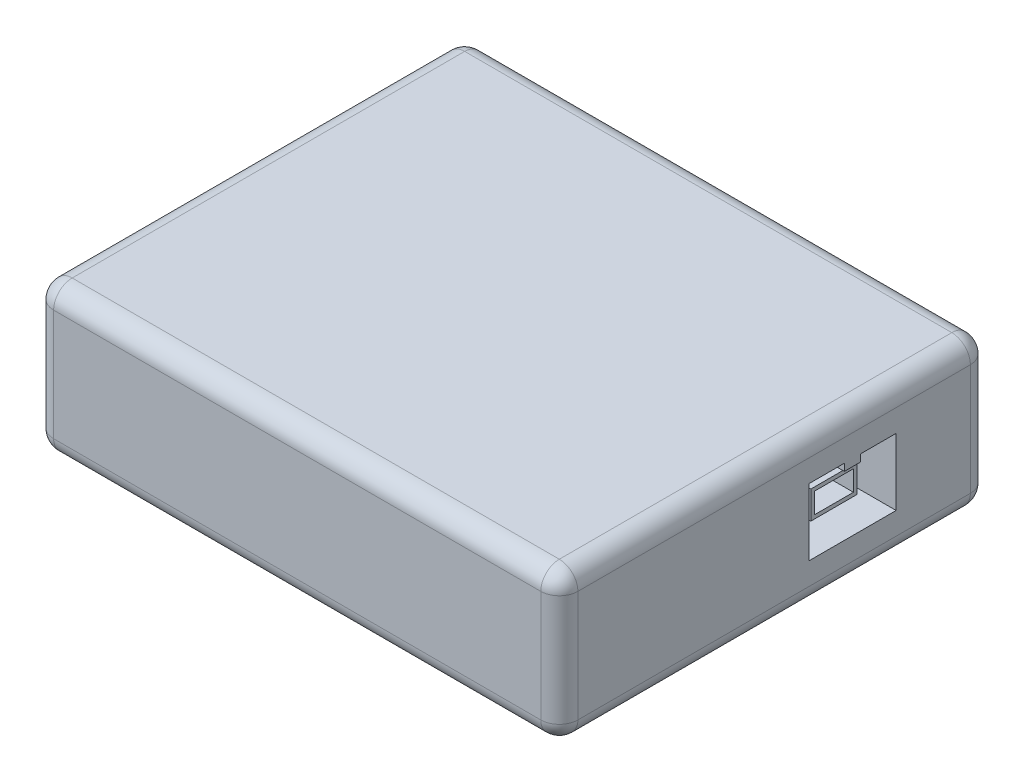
ISO-10303-21;
HEADER;
FILE_DESCRIPTION(('STEP AP214'),'2;1');
FILE_NAME('part.step','',(''),(''),'','','');
FILE_SCHEMA(('AUTOMOTIVE_DESIGN { 1 0 10303 214 1 1 1 1 }'));
ENDSEC;
DATA;
#1=APPLICATION_CONTEXT('core data for automotive mechanical design processes');
#2=APPLICATION_PROTOCOL_DEFINITION('international standard','automotive_design',2000,#1);
#3=PRODUCT_CONTEXT('',#1,'mechanical');
#4=PRODUCT('Part','Part','',(#3));
#5=PRODUCT_RELATED_PRODUCT_CATEGORY('part','',(#4));
#6=PRODUCT_DEFINITION_FORMATION('','',#4);
#7=PRODUCT_DEFINITION_CONTEXT('part definition',#1,'design');
#8=PRODUCT_DEFINITION('design','',#6,#7);
#9=PRODUCT_DEFINITION_SHAPE('','',#8);
#10=(LENGTH_UNIT() NAMED_UNIT(*) SI_UNIT(.MILLI.,.METRE.));
#11=(NAMED_UNIT(*) PLANE_ANGLE_UNIT() SI_UNIT($,.RADIAN.));
#12=(NAMED_UNIT(*) SI_UNIT($,.STERADIAN.) SOLID_ANGLE_UNIT());
#13=UNCERTAINTY_MEASURE_WITH_UNIT(LENGTH_MEASURE(1.E-05),#10,'distance_accuracy_value','');
#14=(GEOMETRIC_REPRESENTATION_CONTEXT(3) GLOBAL_UNCERTAINTY_ASSIGNED_CONTEXT((#13)) GLOBAL_UNIT_ASSIGNED_CONTEXT((#10,
#11,#12)) REPRESENTATION_CONTEXT('',''));
#15=CARTESIAN_POINT('',(0.,0.,0.));
#16=DIRECTION('',(0.,0.,1.));
#17=DIRECTION('',(1.,0.,0.));
#18=AXIS2_PLACEMENT_3D('',#15,#16,#17);
#19=CARTESIAN_POINT('',(-23.1775,-4.572,-4.7625));
#20=DIRECTION('',(1.,0.,0.));
#21=DIRECTION('',(0.,0.,-1.));
#22=AXIS2_PLACEMENT_3D('',#19,#20,#21);
#23=PLANE('',#22);
#24=DIRECTION('',(0.,1.,0.));
#25=VECTOR('',#24,1.);
#26=CARTESIAN_POINT('',(-23.1775,4.572,-4.7625));
#27=LINE('',#26,#25);
#28=CARTESIAN_POINT('',(-23.1775,-4.572,-4.7625));
#29=VERTEX_POINT('',#28);
#30=CARTESIAN_POINT('',(-23.1775,4.572,-4.7625));
#31=VERTEX_POINT('',#30);
#32=EDGE_CURVE('E410',#29,#31,#27,.T.);
#33=ORIENTED_EDGE('',*,*,#32,.T.);
#34=DIRECTION('',(0.,0.,-1.));
#35=VECTOR('',#34,1.);
#36=CARTESIAN_POINT('',(-23.1775,4.572,-4.7625));
#37=LINE('',#36,#35);
#38=CARTESIAN_POINT('',(-23.1775,4.572,-9.6139));
#39=VERTEX_POINT('',#38);
#40=EDGE_CURVE('E413',#31,#39,#37,.T.);
#41=ORIENTED_EDGE('',*,*,#40,.T.);
#42=DIRECTION('',(0.,-1.,0.));
#43=VECTOR('',#42,1.);
#44=CARTESIAN_POINT('',(-23.1775,3.556,-9.6139));
#45=LINE('',#44,#43);
#46=CARTESIAN_POINT('',(-23.1775,3.556,-9.6139));
#47=VERTEX_POINT('',#46);
#48=EDGE_CURVE('E416',#39,#47,#45,.T.);
#49=ORIENTED_EDGE('',*,*,#48,.T.);
#50=DIRECTION('',(0.,0.,-1.));
#51=VECTOR('',#50,1.);
#52=CARTESIAN_POINT('',(-23.1775,3.556,-11.8491));
#53=LINE('',#52,#51);
#54=CARTESIAN_POINT('',(-23.1775,3.556,-11.8491));
#55=VERTEX_POINT('',#54);
#56=EDGE_CURVE('E419',#47,#55,#53,.T.);
#57=ORIENTED_EDGE('',*,*,#56,.T.);
#58=DIRECTION('',(0.,1.,0.));
#59=VECTOR('',#58,1.);
#60=CARTESIAN_POINT('',(-23.1775,4.572,-11.8491));
#61=LINE('',#60,#59);
#62=CARTESIAN_POINT('',(-23.1775,4.572,-11.8491));
#63=VERTEX_POINT('',#62);
#64=EDGE_CURVE('E422',#55,#63,#61,.T.);
#65=ORIENTED_EDGE('',*,*,#64,.T.);
#66=DIRECTION('',(0.,0.,-1.));
#67=VECTOR('',#66,1.);
#68=CARTESIAN_POINT('',(-23.1775,4.572,-11.8491));
#69=LINE('',#68,#67);
#70=CARTESIAN_POINT('',(-23.1775,4.572,-16.7005));
#71=VERTEX_POINT('',#70);
#72=EDGE_CURVE('E425',#63,#71,#69,.T.);
#73=ORIENTED_EDGE('',*,*,#72,.T.);
#74=DIRECTION('',(0.,-1.,0.));
#75=VECTOR('',#74,1.);
#76=CARTESIAN_POINT('',(-23.1775,4.572,-16.7005));
#77=LINE('',#76,#75);
#78=CARTESIAN_POINT('',(-23.1775,-4.572,-16.7005));
#79=VERTEX_POINT('',#78);
#80=EDGE_CURVE('E428',#71,#79,#77,.T.);
#81=ORIENTED_EDGE('',*,*,#80,.T.);
#82=DIRECTION('',(0.,0.,1.));
#83=VECTOR('',#82,1.);
#84=CARTESIAN_POINT('',(-23.1775,-4.572,-4.7625));
#85=LINE('',#84,#83);
#86=EDGE_CURVE('E431',#79,#29,#85,.T.);
#87=ORIENTED_EDGE('',*,*,#86,.T.);
#88=EDGE_LOOP('',(#33,#41,#49,#57,#65,#73,#81,#87));
#89=FACE_BOUND('',#88,.T.);
#90=DIRECTION('',(0.,-1.,0.));
#91=VECTOR('',#90,1.);
#92=CARTESIAN_POINT('',(-23.1775,1.27,-13.9065));
#93=LINE('',#92,#91);
#94=CARTESIAN_POINT('',(-23.1775,1.27,-13.9065));
#95=VERTEX_POINT('',#94);
#96=CARTESIAN_POINT('',(-23.1775,-2.54,-13.9065));
#97=VERTEX_POINT('',#96);
#98=EDGE_CURVE('E331',#95,#97,#93,.T.);
#99=ORIENTED_EDGE('',*,*,#98,.F.);
#100=DIRECTION('',(0.,0.,-1.));
#101=VECTOR('',#100,1.);
#102=CARTESIAN_POINT('',(-23.1775,1.27,-13.9065));
#103=LINE('',#102,#101);
#104=CARTESIAN_POINT('',(-23.1775,1.27,-7.5565));
#105=VERTEX_POINT('',#104);
#106=EDGE_CURVE('E359',#105,#95,#103,.T.);
#107=ORIENTED_EDGE('',*,*,#106,.F.);
#108=DIRECTION('',(0.,1.,0.));
#109=VECTOR('',#108,1.);
#110=CARTESIAN_POINT('',(-23.1775,1.27,-7.55650000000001));
#111=LINE('',#110,#109);
#112=CARTESIAN_POINT('',(-23.1775,-2.54,-7.55650000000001));
#113=VERTEX_POINT('',#112);
#114=EDGE_CURVE('E371',#113,#105,#111,.T.);
#115=ORIENTED_EDGE('',*,*,#114,.F.);
#116=DIRECTION('',(0.,0.,1.));
#117=VECTOR('',#116,1.);
#118=CARTESIAN_POINT('',(-23.1775,-2.54,-13.9065));
#119=LINE('',#118,#117);
#120=EDGE_CURVE('E368',#97,#113,#119,.T.);
#121=ORIENTED_EDGE('',*,*,#120,.F.);
#122=EDGE_LOOP('',(#99,#107,#115,#121));
#123=FACE_BOUND('',#122,.T.);
#124=ADVANCED_FACE('F32',(#89,#123),#23,.F.);
#125=CARTESIAN_POINT('',(23.1775,3.6068,-16.7005));
#126=DIRECTION('',(1.,0.,0.));
#127=DIRECTION('',(0.,0.,-1.));
#128=AXIS2_PLACEMENT_3D('',#125,#126,#127);
#129=PLANE('',#128);
#130=DIRECTION('',(0.,1.,0.));
#131=VECTOR('',#130,1.);
#132=CARTESIAN_POINT('',(23.1775,4.572,-16.7005));
#133=LINE('',#132,#131);
#134=CARTESIAN_POINT('',(23.1775,-4.572,-16.7005));
#135=VERTEX_POINT('',#134);
#136=CARTESIAN_POINT('',(23.1775,4.572,-16.7005));
#137=VERTEX_POINT('',#136);
#138=EDGE_CURVE('E532',#135,#137,#133,.T.);
#139=ORIENTED_EDGE('',*,*,#138,.T.);
#140=DIRECTION('',(0.,0.,1.));
#141=VECTOR('',#140,1.);
#142=CARTESIAN_POINT('',(23.1775,4.572,-16.7005));
#143=LINE('',#142,#141);
#144=CARTESIAN_POINT('',(23.1775,4.572,-11.8491));
#145=VERTEX_POINT('',#144);
#146=EDGE_CURVE('E535',#137,#145,#143,.T.);
#147=ORIENTED_EDGE('',*,*,#146,.T.);
#148=DIRECTION('',(0.,-1.,0.));
#149=VECTOR('',#148,1.);
#150=CARTESIAN_POINT('',(23.1775,3.6068,-11.8491));
#151=LINE('',#150,#149);
#152=CARTESIAN_POINT('',(23.1775,3.6068,-11.8491));
#153=VERTEX_POINT('',#152);
#154=EDGE_CURVE('E538',#145,#153,#151,.T.);
#155=ORIENTED_EDGE('',*,*,#154,.T.);
#156=DIRECTION('',(0.,0.,1.));
#157=VECTOR('',#156,1.);
#158=CARTESIAN_POINT('',(23.1775,3.6068,-9.6139));
#159=LINE('',#158,#157);
#160=CARTESIAN_POINT('',(23.1775,3.6068,-9.6139));
#161=VERTEX_POINT('',#160);
#162=EDGE_CURVE('E541',#153,#161,#159,.T.);
#163=ORIENTED_EDGE('',*,*,#162,.T.);
#164=DIRECTION('',(0.,1.,0.));
#165=VECTOR('',#164,1.);
#166=CARTESIAN_POINT('',(23.1775,4.572,-9.6139));
#167=LINE('',#166,#165);
#168=CARTESIAN_POINT('',(23.1775,4.572,-9.6139));
#169=VERTEX_POINT('',#168);
#170=EDGE_CURVE('E544',#161,#169,#167,.T.);
#171=ORIENTED_EDGE('',*,*,#170,.T.);
#172=DIRECTION('',(0.,0.,1.));
#173=VECTOR('',#172,1.);
#174=CARTESIAN_POINT('',(23.1775,4.572,-9.6139));
#175=LINE('',#174,#173);
#176=CARTESIAN_POINT('',(23.1775,4.572,-4.7625));
#177=VERTEX_POINT('',#176);
#178=EDGE_CURVE('E547',#169,#177,#175,.T.);
#179=ORIENTED_EDGE('',*,*,#178,.T.);
#180=DIRECTION('',(0.,-1.,0.));
#181=VECTOR('',#180,1.);
#182=CARTESIAN_POINT('',(23.1775,4.572,-4.7625));
#183=LINE('',#182,#181);
#184=CARTESIAN_POINT('',(23.1775,-4.572,-4.7625));
#185=VERTEX_POINT('',#184);
#186=EDGE_CURVE('E550',#177,#185,#183,.T.);
#187=ORIENTED_EDGE('',*,*,#186,.T.);
#188=DIRECTION('',(0.,0.,-1.));
#189=VECTOR('',#188,1.);
#190=CARTESIAN_POINT('',(23.1775,-4.572,-16.7005));
#191=LINE('',#190,#189);
#192=EDGE_CURVE('E553',#185,#135,#191,.T.);
#193=ORIENTED_EDGE('',*,*,#192,.T.);
#194=EDGE_LOOP('',(#139,#147,#155,#163,#171,#179,#187,#193));
#195=FACE_BOUND('',#194,.T.);
#196=DIRECTION('',(0.,0.,-1.));
#197=VECTOR('',#196,1.);
#198=CARTESIAN_POINT('',(23.1775,-2.54,-7.5565));
#199=LINE('',#198,#197);
#200=CARTESIAN_POINT('',(23.1775,-2.54,-7.5565));
#201=VERTEX_POINT('',#200);
#202=CARTESIAN_POINT('',(23.1775,-2.54,-13.9065));
#203=VERTEX_POINT('',#202);
#204=EDGE_CURVE('E483',#201,#203,#199,.T.);
#205=ORIENTED_EDGE('',*,*,#204,.F.);
#206=DIRECTION('',(0.,-1.,0.));
#207=VECTOR('',#206,1.);
#208=CARTESIAN_POINT('',(23.1775,1.27,-7.5565));
#209=LINE('',#208,#207);
#210=CARTESIAN_POINT('',(23.1775,1.27,-7.5565));
#211=VERTEX_POINT('',#210);
#212=EDGE_CURVE('E480',#211,#201,#209,.T.);
#213=ORIENTED_EDGE('',*,*,#212,.F.);
#214=DIRECTION('',(0.,0.,1.));
#215=VECTOR('',#214,1.);
#216=CARTESIAN_POINT('',(23.1775,1.27,-7.5565));
#217=LINE('',#216,#215);
#218=CARTESIAN_POINT('',(23.1775,1.27,-13.9065));
#219=VERTEX_POINT('',#218);
#220=EDGE_CURVE('E488',#219,#211,#217,.T.);
#221=ORIENTED_EDGE('',*,*,#220,.F.);
#222=DIRECTION('',(0.,1.,0.));
#223=VECTOR('',#222,1.);
#224=CARTESIAN_POINT('',(23.1775,1.27,-13.9065));
#225=LINE('',#224,#223);
#226=EDGE_CURVE('E485',#203,#219,#225,.T.);
#227=ORIENTED_EDGE('',*,*,#226,.F.);
#228=EDGE_LOOP('',(#205,#213,#221,#227));
#229=FACE_BOUND('',#228,.T.);
#230=ADVANCED_FACE('F765',(#195,#229),#129,.T.);
#231=CARTESIAN_POINT('',(-35.8775,10.16,-29.4005));
#232=DIRECTION('',(1.,0.,0.));
#233=DIRECTION('',(0.,0.,-1.));
#234=AXIS2_PLACEMENT_3D('',#231,#232,#233);
#235=PLANE('',#234);
#236=DIRECTION('',(0.,-1.,0.));
#237=VECTOR('',#236,1.);
#238=CARTESIAN_POINT('',(-35.8775,10.16,-26.8605));
#239=LINE('',#238,#237);
#240=CARTESIAN_POINT('',(-35.8775,7.62,-26.8605));
#241=VERTEX_POINT('',#240);
#242=CARTESIAN_POINT('',(-35.8775,-7.62,-26.8605));
#243=VERTEX_POINT('',#242);
#244=EDGE_CURVE('E609',#241,#243,#239,.T.);
#245=ORIENTED_EDGE('',*,*,#244,.T.);
#246=DIRECTION('',(0.,0.,1.));
#247=VECTOR('',#246,1.);
#248=CARTESIAN_POINT('',(-35.8775,-7.62,-29.4005));
#249=LINE('',#248,#247);
#250=CARTESIAN_POINT('',(-35.8775,-7.62,26.8605));
#251=VERTEX_POINT('',#250);
#252=EDGE_CURVE('E615',#243,#251,#249,.T.);
#253=ORIENTED_EDGE('',*,*,#252,.T.);
#254=DIRECTION('',(0.,-1.,0.));
#255=VECTOR('',#254,1.);
#256=CARTESIAN_POINT('',(-35.8775,10.16,26.8605));
#257=LINE('',#256,#255);
#258=CARTESIAN_POINT('',(-35.8775,7.62,26.8605));
#259=VERTEX_POINT('',#258);
#260=EDGE_CURVE('E613',#251,#259,#257,.F.);
#261=ORIENTED_EDGE('',*,*,#260,.T.);
#262=DIRECTION('',(0.,0.,1.));
#263=VECTOR('',#262,1.);
#264=CARTESIAN_POINT('',(-35.8775,7.62,-29.4005));
#265=LINE('',#264,#263);
#266=EDGE_CURVE('E611',#259,#241,#265,.F.);
#267=ORIENTED_EDGE('',*,*,#266,.T.);
#268=EDGE_LOOP('',(#245,#253,#261,#267));
#269=FACE_BOUND('',#268,.T.);
#270=DIRECTION('',(0.,0.,-1.));
#271=VECTOR('',#270,1.);
#272=CARTESIAN_POINT('',(-35.8775,4.572,-4.7625));
#273=LINE('',#272,#271);
#274=CARTESIAN_POINT('',(-35.8775,4.572,-4.7625));
#275=VERTEX_POINT('',#274);
#276=CARTESIAN_POINT('',(-35.8775,4.572,-9.6139));
#277=VERTEX_POINT('',#276);
#278=EDGE_CURVE('E389',#275,#277,#273,.T.);
#279=ORIENTED_EDGE('',*,*,#278,.F.);
#280=DIRECTION('',(0.,1.,0.));
#281=VECTOR('',#280,1.);
#282=CARTESIAN_POINT('',(-35.8775,4.572,-4.7625));
#283=LINE('',#282,#281);
#284=CARTESIAN_POINT('',(-35.8775,-4.572,-4.7625));
#285=VERTEX_POINT('',#284);
#286=EDGE_CURVE('E387',#285,#275,#283,.T.);
#287=ORIENTED_EDGE('',*,*,#286,.F.);
#288=DIRECTION('',(0.,0.,1.));
#289=VECTOR('',#288,1.);
#290=CARTESIAN_POINT('',(-35.8775,-4.572,-4.7625));
#291=LINE('',#290,#289);
#292=CARTESIAN_POINT('',(-35.8775,-4.572,-16.7005));
#293=VERTEX_POINT('',#292);
#294=EDGE_CURVE('E407',#293,#285,#291,.T.);
#295=ORIENTED_EDGE('',*,*,#294,.F.);
#296=DIRECTION('',(0.,-1.,0.));
#297=VECTOR('',#296,1.);
#298=CARTESIAN_POINT('',(-35.8775,4.572,-16.7005));
#299=LINE('',#298,#297);
#300=CARTESIAN_POINT('',(-35.8775,4.572,-16.7005));
#301=VERTEX_POINT('',#300);
#302=EDGE_CURVE('E404',#301,#293,#299,.T.);
#303=ORIENTED_EDGE('',*,*,#302,.F.);
#304=DIRECTION('',(0.,0.,-1.));
#305=VECTOR('',#304,1.);
#306=CARTESIAN_POINT('',(-35.8775,4.572,-11.8491));
#307=LINE('',#306,#305);
#308=CARTESIAN_POINT('',(-35.8775,4.572,-11.8491));
#309=VERTEX_POINT('',#308);
#310=EDGE_CURVE('E401',#309,#301,#307,.T.);
#311=ORIENTED_EDGE('',*,*,#310,.F.);
#312=DIRECTION('',(0.,1.,0.));
#313=VECTOR('',#312,1.);
#314=CARTESIAN_POINT('',(-35.8775,4.572,-11.8491));
#315=LINE('',#314,#313);
#316=CARTESIAN_POINT('',(-35.8775,3.556,-11.8491));
#317=VERTEX_POINT('',#316);
#318=EDGE_CURVE('E398',#317,#309,#315,.T.);
#319=ORIENTED_EDGE('',*,*,#318,.F.);
#320=DIRECTION('',(0.,0.,-1.));
#321=VECTOR('',#320,1.);
#322=CARTESIAN_POINT('',(-35.8775,3.556,-11.8491));
#323=LINE('',#322,#321);
#324=CARTESIAN_POINT('',(-35.8775,3.556,-9.6139));
#325=VERTEX_POINT('',#324);
#326=EDGE_CURVE('E395',#325,#317,#323,.T.);
#327=ORIENTED_EDGE('',*,*,#326,.F.);
#328=DIRECTION('',(0.,-1.,0.));
#329=VECTOR('',#328,1.);
#330=CARTESIAN_POINT('',(-35.8775,3.556,-9.6139));
#331=LINE('',#330,#329);
#332=EDGE_CURVE('E392',#277,#325,#331,.T.);
#333=ORIENTED_EDGE('',*,*,#332,.F.);
#334=EDGE_LOOP('',(#279,#287,#295,#303,#311,#319,#327,#333));
#335=FACE_BOUND('',#334,.T.);
#336=ADVANCED_FACE('F733',(#269,#335),#235,.F.);
#337=CARTESIAN_POINT('',(-35.8775,10.16,29.4005));
#338=DIRECTION('',(0.,0.,-1.));
#339=DIRECTION('',(-1.,0.,0.));
#340=AXIS2_PLACEMENT_3D('',#337,#338,#339);
#341=PLANE('',#340);
#342=DIRECTION('',(0.,-1.,0.));
#343=VECTOR('',#342,1.);
#344=CARTESIAN_POINT('',(-33.3375,10.16,29.4005));
#345=LINE('',#344,#343);
#346=CARTESIAN_POINT('',(-33.3375,7.62,29.4005));
#347=VERTEX_POINT('',#346);
#348=CARTESIAN_POINT('',(-33.3375,-7.62,29.4005));
#349=VERTEX_POINT('',#348);
#350=EDGE_CURVE('E604',#347,#349,#345,.T.);
#351=ORIENTED_EDGE('',*,*,#350,.T.);
#352=DIRECTION('',(1.,0.,0.));
#353=VECTOR('',#352,1.);
#354=CARTESIAN_POINT('',(-35.8775,-7.62,29.4005));
#355=LINE('',#354,#353);
#356=CARTESIAN_POINT('',(33.3375,-7.62,29.4005));
#357=VERTEX_POINT('',#356);
#358=EDGE_CURVE('E606',#349,#357,#355,.T.);
#359=ORIENTED_EDGE('',*,*,#358,.T.);
#360=DIRECTION('',(0.,-1.,0.));
#361=VECTOR('',#360,1.);
#362=CARTESIAN_POINT('',(33.3375,10.16,29.4005));
#363=LINE('',#362,#361);
#364=CARTESIAN_POINT('',(33.3375,7.62,29.4005));
#365=VERTEX_POINT('',#364);
#366=EDGE_CURVE('E602',#357,#365,#363,.F.);
#367=ORIENTED_EDGE('',*,*,#366,.T.);
#368=DIRECTION('',(1.,0.,0.));
#369=VECTOR('',#368,1.);
#370=CARTESIAN_POINT('',(-35.8775,7.62,29.4005));
#371=LINE('',#370,#369);
#372=EDGE_CURVE('E600',#365,#347,#371,.F.);
#373=ORIENTED_EDGE('',*,*,#372,.T.);
#374=EDGE_LOOP('',(#351,#359,#367,#373));
#375=FACE_BOUND('',#374,.T.);
#376=ADVANCED_FACE('F703',(#375),#341,.F.);
#377=CARTESIAN_POINT('',(35.8775,10.16,-29.4005));
#378=DIRECTION('',(-1.,0.,0.));
#379=DIRECTION('',(0.,0.,1.));
#380=AXIS2_PLACEMENT_3D('',#377,#378,#379);
#381=PLANE('',#380);
#382=DIRECTION('',(0.,-1.,0.));
#383=VECTOR('',#382,1.);
#384=CARTESIAN_POINT('',(35.8775,10.16,26.8605));
#385=LINE('',#384,#383);
#386=CARTESIAN_POINT('',(35.8775,7.62,26.8605));
#387=VERTEX_POINT('',#386);
#388=CARTESIAN_POINT('',(35.8775,-7.62,26.8605));
#389=VERTEX_POINT('',#388);
#390=EDGE_CURVE('E559',#387,#389,#385,.T.);
#391=ORIENTED_EDGE('',*,*,#390,.T.);
#392=DIRECTION('',(0.,0.,-1.));
#393=VECTOR('',#392,1.);
#394=CARTESIAN_POINT('',(35.8775,-7.62,-29.4005));
#395=LINE('',#394,#393);
#396=CARTESIAN_POINT('',(35.8775,-7.62,-26.8605));
#397=VERTEX_POINT('',#396);
#398=EDGE_CURVE('E579',#389,#397,#395,.T.);
#399=ORIENTED_EDGE('',*,*,#398,.T.);
#400=DIRECTION('',(0.,-1.,0.));
#401=VECTOR('',#400,1.);
#402=CARTESIAN_POINT('',(35.8775,10.16,-26.8605));
#403=LINE('',#402,#401);
#404=CARTESIAN_POINT('',(35.8775,7.62,-26.8605));
#405=VERTEX_POINT('',#404);
#406=EDGE_CURVE('E577',#397,#405,#403,.F.);
#407=ORIENTED_EDGE('',*,*,#406,.T.);
#408=DIRECTION('',(0.,0.,-1.));
#409=VECTOR('',#408,1.);
#410=CARTESIAN_POINT('',(35.8775,7.62,29.4005));
#411=LINE('',#410,#409);
#412=EDGE_CURVE('E575',#405,#387,#411,.F.);
#413=ORIENTED_EDGE('',*,*,#412,.T.);
#414=EDGE_LOOP('',(#391,#399,#407,#413));
#415=FACE_BOUND('',#414,.T.);
#416=DIRECTION('',(0.,0.,1.));
#417=VECTOR('',#416,1.);
#418=CARTESIAN_POINT('',(35.8775,4.572,-16.7005));
#419=LINE('',#418,#417);
#420=CARTESIAN_POINT('',(35.8775,4.572,-16.7005));
#421=VERTEX_POINT('',#420);
#422=CARTESIAN_POINT('',(35.8775,4.572,-11.8491));
#423=VERTEX_POINT('',#422);
#424=EDGE_CURVE('E511',#421,#423,#419,.T.);
#425=ORIENTED_EDGE('',*,*,#424,.F.);
#426=DIRECTION('',(0.,1.,0.));
#427=VECTOR('',#426,1.);
#428=CARTESIAN_POINT('',(35.8775,4.572,-16.7005));
#429=LINE('',#428,#427);
#430=CARTESIAN_POINT('',(35.8775,-4.572,-16.7005));
#431=VERTEX_POINT('',#430);
#432=EDGE_CURVE('E509',#431,#421,#429,.T.);
#433=ORIENTED_EDGE('',*,*,#432,.F.);
#434=DIRECTION('',(0.,0.,-1.));
#435=VECTOR('',#434,1.);
#436=CARTESIAN_POINT('',(35.8775,-4.572,-16.7005));
#437=LINE('',#436,#435);
#438=CARTESIAN_POINT('',(35.8775,-4.572,-4.7625));
#439=VERTEX_POINT('',#438);
#440=EDGE_CURVE('E529',#439,#431,#437,.T.);
#441=ORIENTED_EDGE('',*,*,#440,.F.);
#442=DIRECTION('',(0.,-1.,0.));
#443=VECTOR('',#442,1.);
#444=CARTESIAN_POINT('',(35.8775,4.572,-4.7625));
#445=LINE('',#444,#443);
#446=CARTESIAN_POINT('',(35.8775,4.572,-4.7625));
#447=VERTEX_POINT('',#446);
#448=EDGE_CURVE('E526',#447,#439,#445,.T.);
#449=ORIENTED_EDGE('',*,*,#448,.F.);
#450=DIRECTION('',(0.,0.,1.));
#451=VECTOR('',#450,1.);
#452=CARTESIAN_POINT('',(35.8775,4.572,-9.6139));
#453=LINE('',#452,#451);
#454=CARTESIAN_POINT('',(35.8775,4.572,-9.6139));
#455=VERTEX_POINT('',#454);
#456=EDGE_CURVE('E523',#455,#447,#453,.T.);
#457=ORIENTED_EDGE('',*,*,#456,.F.);
#458=DIRECTION('',(0.,1.,0.));
#459=VECTOR('',#458,1.);
#460=CARTESIAN_POINT('',(35.8775,4.572,-9.6139));
#461=LINE('',#460,#459);
#462=CARTESIAN_POINT('',(35.8775,3.6068,-9.6139));
#463=VERTEX_POINT('',#462);
#464=EDGE_CURVE('E520',#463,#455,#461,.T.);
#465=ORIENTED_EDGE('',*,*,#464,.F.);
#466=DIRECTION('',(0.,0.,1.));
#467=VECTOR('',#466,1.);
#468=CARTESIAN_POINT('',(35.8775,3.6068,-9.6139));
#469=LINE('',#468,#467);
#470=CARTESIAN_POINT('',(35.8775,3.6068,-11.8491));
#471=VERTEX_POINT('',#470);
#472=EDGE_CURVE('E517',#471,#463,#469,.T.);
#473=ORIENTED_EDGE('',*,*,#472,.F.);
#474=DIRECTION('',(0.,-1.,0.));
#475=VECTOR('',#474,1.);
#476=CARTESIAN_POINT('',(35.8775,3.6068,-11.8491));
#477=LINE('',#476,#475);
#478=EDGE_CURVE('E514',#423,#471,#477,.T.);
#479=ORIENTED_EDGE('',*,*,#478,.F.);
#480=EDGE_LOOP('',(#425,#433,#441,#449,#457,#465,#473,#479));
#481=FACE_BOUND('',#480,.T.);
#482=ADVANCED_FACE('F884',(#415,#481),#381,.F.);
#483=CARTESIAN_POINT('',(-35.8775,10.16,-29.4005));
#484=DIRECTION('',(0.,0.,1.));
#485=DIRECTION('',(1.,0.,0.));
#486=AXIS2_PLACEMENT_3D('',#483,#484,#485);
#487=PLANE('',#486);
#488=DIRECTION('',(0.,-1.,0.));
#489=VECTOR('',#488,1.);
#490=CARTESIAN_POINT('',(33.3375,10.16,-29.4005));
#491=LINE('',#490,#489);
#492=CARTESIAN_POINT('',(33.3375,7.62,-29.4005));
#493=VERTEX_POINT('',#492);
#494=CARTESIAN_POINT('',(33.3375,-7.62,-29.4005));
#495=VERTEX_POINT('',#494);
#496=EDGE_CURVE('E591',#493,#495,#491,.T.);
#497=ORIENTED_EDGE('',*,*,#496,.T.);
#498=DIRECTION('',(-1.,0.,0.));
#499=VECTOR('',#498,1.);
#500=CARTESIAN_POINT('',(-35.8775,-7.62,-29.4005));
#501=LINE('',#500,#499);
#502=CARTESIAN_POINT('',(-33.3375,-7.62,-29.4005));
#503=VERTEX_POINT('',#502);
#504=EDGE_CURVE('E597',#495,#503,#501,.T.);
#505=ORIENTED_EDGE('',*,*,#504,.T.);
#506=DIRECTION('',(0.,-1.,0.));
#507=VECTOR('',#506,1.);
#508=CARTESIAN_POINT('',(-33.3375,10.16,-29.4005));
#509=LINE('',#508,#507);
#510=CARTESIAN_POINT('',(-33.3375,7.62,-29.4005));
#511=VERTEX_POINT('',#510);
#512=EDGE_CURVE('E595',#503,#511,#509,.F.);
#513=ORIENTED_EDGE('',*,*,#512,.T.);
#514=DIRECTION('',(-1.,0.,0.));
#515=VECTOR('',#514,1.);
#516=CARTESIAN_POINT('',(35.8775,7.62,-29.4005));
#517=LINE('',#516,#515);
#518=EDGE_CURVE('E593',#511,#493,#517,.F.);
#519=ORIENTED_EDGE('',*,*,#518,.T.);
#520=EDGE_LOOP('',(#497,#505,#513,#519));
#521=FACE_BOUND('',#520,.T.);
#522=ADVANCED_FACE('F893',(#521),#487,.F.);
#523=CARTESIAN_POINT('',(-35.8775,10.16,29.4005));
#524=DIRECTION('',(0.,1.,0.));
#525=DIRECTION('',(0.,0.,1.));
#526=AXIS2_PLACEMENT_3D('',#523,#524,#525);
#527=PLANE('',#526);
#528=DIRECTION('',(-1.,0.,0.));
#529=VECTOR('',#528,1.);
#530=CARTESIAN_POINT('',(-35.8775,10.16,-26.8605));
#531=LINE('',#530,#529);
#532=CARTESIAN_POINT('',(33.3375,10.16,-26.8605));
#533=VERTEX_POINT('',#532);
#534=CARTESIAN_POINT('',(-33.3375,10.16,-26.8605));
#535=VERTEX_POINT('',#534);
#536=EDGE_CURVE('E41',#533,#535,#531,.T.);
#537=ORIENTED_EDGE('',*,*,#536,.T.);
#538=DIRECTION('',(0.,0.,1.));
#539=VECTOR('',#538,1.);
#540=CARTESIAN_POINT('',(-33.3375,10.16,29.4005));
#541=LINE('',#540,#539);
#542=CARTESIAN_POINT('',(-33.3375,10.16,26.8605));
#543=VERTEX_POINT('',#542);
#544=EDGE_CURVE('E11',#535,#543,#541,.T.);
#545=ORIENTED_EDGE('',*,*,#544,.T.);
#546=DIRECTION('',(1.,0.,0.));
#547=VECTOR('',#546,1.);
#548=CARTESIAN_POINT('',(35.8775,10.16,26.8605));
#549=LINE('',#548,#547);
#550=CARTESIAN_POINT('',(33.3375,10.16,26.8605));
#551=VERTEX_POINT('',#550);
#552=EDGE_CURVE('E618',#543,#551,#549,.T.);
#553=ORIENTED_EDGE('',*,*,#552,.T.);
#554=DIRECTION('',(0.,0.,-1.));
#555=VECTOR('',#554,1.);
#556=CARTESIAN_POINT('',(33.3375,10.16,-29.4005));
#557=LINE('',#556,#555);
#558=EDGE_CURVE('E52',#551,#533,#557,.T.);
#559=ORIENTED_EDGE('',*,*,#558,.T.);
#560=EDGE_LOOP('',(#537,#545,#553,#559));
#561=FACE_BOUND('',#560,.T.);
#562=ADVANCED_FACE('F710',(#561),#527,.T.);
#563=CARTESIAN_POINT('',(-35.8775,-10.16,29.4005));
#564=DIRECTION('',(0.,1.,0.));
#565=DIRECTION('',(0.,0.,1.));
#566=AXIS2_PLACEMENT_3D('',#563,#564,#565);
#567=PLANE('',#566);
#568=DIRECTION('',(-1.,0.,0.));
#569=VECTOR('',#568,1.);
#570=CARTESIAN_POINT('',(-35.8775,-10.16,-26.8605));
#571=LINE('',#570,#569);
#572=CARTESIAN_POINT('',(-33.3375,-10.16,-26.8605));
#573=VERTEX_POINT('',#572);
#574=CARTESIAN_POINT('',(33.3375,-10.16,-26.8605));
#575=VERTEX_POINT('',#574);
#576=EDGE_CURVE('E586',#573,#575,#571,.F.);
#577=ORIENTED_EDGE('',*,*,#576,.T.);
#578=DIRECTION('',(0.,0.,-1.));
#579=VECTOR('',#578,1.);
#580=CARTESIAN_POINT('',(33.3375,-10.16,29.4005));
#581=LINE('',#580,#579);
#582=CARTESIAN_POINT('',(33.3375,-10.16,26.8605));
#583=VERTEX_POINT('',#582);
#584=EDGE_CURVE('E588',#575,#583,#581,.F.);
#585=ORIENTED_EDGE('',*,*,#584,.T.);
#586=DIRECTION('',(1.,0.,0.));
#587=VECTOR('',#586,1.);
#588=CARTESIAN_POINT('',(-35.8775,-10.16,26.8605));
#589=LINE('',#588,#587);
#590=CARTESIAN_POINT('',(-33.3375,-10.16,26.8605));
#591=VERTEX_POINT('',#590);
#592=EDGE_CURVE('E584',#583,#591,#589,.F.);
#593=ORIENTED_EDGE('',*,*,#592,.T.);
#594=DIRECTION('',(0.,0.,1.));
#595=VECTOR('',#594,1.);
#596=CARTESIAN_POINT('',(-33.3375,-10.16,29.4005));
#597=LINE('',#596,#595);
#598=EDGE_CURVE('E582',#591,#573,#597,.F.);
#599=ORIENTED_EDGE('',*,*,#598,.T.);
#600=EDGE_LOOP('',(#577,#585,#593,#599));
#601=FACE_BOUND('',#600,.T.);
#602=ADVANCED_FACE('F912',(#601),#567,.F.);
#603=CARTESIAN_POINT('',(23.1775,4.572,-16.7005));
#604=DIRECTION('',(0.,0.,-1.));
#605=DIRECTION('',(-1.,0.,0.));
#606=AXIS2_PLACEMENT_3D('',#603,#604,#605);
#607=PLANE('',#606);
#608=ORIENTED_EDGE('',*,*,#432,.T.);
#609=DIRECTION('',(1.,0.,0.));
#610=VECTOR('',#609,1.);
#611=CARTESIAN_POINT('',(23.1775,4.572,-16.7005));
#612=LINE('',#611,#610);
#613=EDGE_CURVE('E556',#137,#421,#612,.T.);
#614=ORIENTED_EDGE('',*,*,#613,.F.);
#615=ORIENTED_EDGE('',*,*,#138,.F.);
#616=DIRECTION('',(1.,0.,0.));
#617=VECTOR('',#616,1.);
#618=CARTESIAN_POINT('',(23.1775,-4.572,-16.7005));
#619=LINE('',#618,#617);
#620=EDGE_CURVE('E557',#135,#431,#619,.T.);
#621=ORIENTED_EDGE('',*,*,#620,.T.);
#622=EDGE_LOOP('',(#608,#614,#615,#621));
#623=FACE_BOUND('',#622,.T.);
#624=ADVANCED_FACE('F921',(#623),#607,.F.);
#625=CARTESIAN_POINT('',(23.1775,-4.572,-16.7005));
#626=DIRECTION('',(0.,-1.,0.));
#627=DIRECTION('',(0.,0.,-1.));
#628=AXIS2_PLACEMENT_3D('',#625,#626,#627);
#629=PLANE('',#628);
#630=ORIENTED_EDGE('',*,*,#440,.T.);
#631=ORIENTED_EDGE('',*,*,#620,.F.);
#632=ORIENTED_EDGE('',*,*,#192,.F.);
#633=DIRECTION('',(1.,0.,0.));
#634=VECTOR('',#633,1.);
#635=CARTESIAN_POINT('',(23.1775,-4.572,-4.7625));
#636=LINE('',#635,#634);
#637=EDGE_CURVE('E560',#185,#439,#636,.T.);
#638=ORIENTED_EDGE('',*,*,#637,.T.);
#639=EDGE_LOOP('',(#630,#631,#632,#638));
#640=FACE_BOUND('',#639,.T.);
#641=ADVANCED_FACE('F1088',(#640),#629,.F.);
#642=CARTESIAN_POINT('',(23.1775,4.572,-4.7625));
#643=DIRECTION('',(0.,0.,1.));
#644=DIRECTION('',(1.,0.,0.));
#645=AXIS2_PLACEMENT_3D('',#642,#643,#644);
#646=PLANE('',#645);
#647=ORIENTED_EDGE('',*,*,#448,.T.);
#648=ORIENTED_EDGE('',*,*,#637,.F.);
#649=ORIENTED_EDGE('',*,*,#186,.F.);
#650=DIRECTION('',(1.,0.,0.));
#651=VECTOR('',#650,1.);
#652=CARTESIAN_POINT('',(23.1775,4.572,-4.7625));
#653=LINE('',#652,#651);
#654=EDGE_CURVE('E562',#177,#447,#653,.T.);
#655=ORIENTED_EDGE('',*,*,#654,.T.);
#656=EDGE_LOOP('',(#647,#648,#649,#655));
#657=FACE_BOUND('',#656,.T.);
#658=ADVANCED_FACE('F1110',(#657),#646,.F.);
#659=CARTESIAN_POINT('',(23.1775,4.572,-9.6139));
#660=DIRECTION('',(0.,1.,0.));
#661=DIRECTION('',(0.,0.,1.));
#662=AXIS2_PLACEMENT_3D('',#659,#660,#661);
#663=PLANE('',#662);
#664=ORIENTED_EDGE('',*,*,#456,.T.);
#665=ORIENTED_EDGE('',*,*,#654,.F.);
#666=ORIENTED_EDGE('',*,*,#178,.F.);
#667=DIRECTION('',(1.,0.,0.));
#668=VECTOR('',#667,1.);
#669=CARTESIAN_POINT('',(23.1775,4.572,-9.6139));
#670=LINE('',#669,#668);
#671=EDGE_CURVE('E564',#169,#455,#670,.T.);
#672=ORIENTED_EDGE('',*,*,#671,.T.);
#673=EDGE_LOOP('',(#664,#665,#666,#672));
#674=FACE_BOUND('',#673,.T.);
#675=ADVANCED_FACE('F1106',(#674),#663,.F.);
#676=CARTESIAN_POINT('',(23.1775,4.572,-9.6139));
#677=DIRECTION('',(0.,0.,-1.));
#678=DIRECTION('',(-1.,0.,0.));
#679=AXIS2_PLACEMENT_3D('',#676,#677,#678);
#680=PLANE('',#679);
#681=ORIENTED_EDGE('',*,*,#464,.T.);
#682=ORIENTED_EDGE('',*,*,#671,.F.);
#683=ORIENTED_EDGE('',*,*,#170,.F.);
#684=DIRECTION('',(1.,0.,0.));
#685=VECTOR('',#684,1.);
#686=CARTESIAN_POINT('',(23.1775,3.6068,-9.6139));
#687=LINE('',#686,#685);
#688=EDGE_CURVE('E566',#161,#463,#687,.T.);
#689=ORIENTED_EDGE('',*,*,#688,.T.);
#690=EDGE_LOOP('',(#681,#682,#683,#689));
#691=FACE_BOUND('',#690,.T.);
#692=ADVANCED_FACE('F1102',(#691),#680,.F.);
#693=CARTESIAN_POINT('',(23.1775,3.6068,-9.6139));
#694=DIRECTION('',(0.,1.,0.));
#695=DIRECTION('',(0.,0.,1.));
#696=AXIS2_PLACEMENT_3D('',#693,#694,#695);
#697=PLANE('',#696);
#698=ORIENTED_EDGE('',*,*,#472,.T.);
#699=ORIENTED_EDGE('',*,*,#688,.F.);
#700=ORIENTED_EDGE('',*,*,#162,.F.);
#701=DIRECTION('',(1.,0.,0.));
#702=VECTOR('',#701,1.);
#703=CARTESIAN_POINT('',(23.1775,3.6068,-11.8491));
#704=LINE('',#703,#702);
#705=EDGE_CURVE('E568',#153,#471,#704,.T.);
#706=ORIENTED_EDGE('',*,*,#705,.T.);
#707=EDGE_LOOP('',(#698,#699,#700,#706));
#708=FACE_BOUND('',#707,.T.);
#709=ADVANCED_FACE('F1098',(#708),#697,.F.);
#710=CARTESIAN_POINT('',(23.1775,3.6068,-11.8491));
#711=DIRECTION('',(0.,0.,1.));
#712=DIRECTION('',(1.,0.,0.));
#713=AXIS2_PLACEMENT_3D('',#710,#711,#712);
#714=PLANE('',#713);
#715=ORIENTED_EDGE('',*,*,#478,.T.);
#716=ORIENTED_EDGE('',*,*,#705,.F.);
#717=ORIENTED_EDGE('',*,*,#154,.F.);
#718=DIRECTION('',(1.,0.,0.));
#719=VECTOR('',#718,1.);
#720=CARTESIAN_POINT('',(23.1775,4.572,-11.8491));
#721=LINE('',#720,#719);
#722=EDGE_CURVE('E570',#145,#423,#721,.T.);
#723=ORIENTED_EDGE('',*,*,#722,.T.);
#724=EDGE_LOOP('',(#715,#716,#717,#723));
#725=FACE_BOUND('',#724,.T.);
#726=ADVANCED_FACE('F1094',(#725),#714,.F.);
#727=CARTESIAN_POINT('',(23.1775,4.572,-16.7005));
#728=DIRECTION('',(0.,1.,0.));
#729=DIRECTION('',(0.,0.,1.));
#730=AXIS2_PLACEMENT_3D('',#727,#728,#729);
#731=PLANE('',#730);
#732=ORIENTED_EDGE('',*,*,#424,.T.);
#733=ORIENTED_EDGE('',*,*,#722,.F.);
#734=ORIENTED_EDGE('',*,*,#146,.F.);
#735=ORIENTED_EDGE('',*,*,#613,.T.);
#736=EDGE_LOOP('',(#732,#733,#734,#735));
#737=FACE_BOUND('',#736,.T.);
#738=ADVANCED_FACE('F1090',(#737),#731,.F.);
#739=CARTESIAN_POINT('',(33.3375,-2.54,-7.5565));
#740=DIRECTION('',(1.,0.,0.));
#741=DIRECTION('',(0.,0.,-1.));
#742=AXIS2_PLACEMENT_3D('',#739,#740,#741);
#743=PLANE('',#742);
#744=DIRECTION('',(0.,-1.,0.));
#745=VECTOR('',#744,1.);
#746=CARTESIAN_POINT('',(33.3375,1.27,-7.5565));
#747=LINE('',#746,#745);
#748=CARTESIAN_POINT('',(33.3375,1.27,-7.5565));
#749=VERTEX_POINT('',#748);
#750=CARTESIAN_POINT('',(33.3375,-2.54,-7.5565));
#751=VERTEX_POINT('',#750);
#752=EDGE_CURVE('E490',#749,#751,#747,.T.);
#753=ORIENTED_EDGE('',*,*,#752,.T.);
#754=DIRECTION('',(0.,0.,-1.));
#755=VECTOR('',#754,1.);
#756=CARTESIAN_POINT('',(33.3375,-2.54,-7.5565));
#757=LINE('',#756,#755);
#758=CARTESIAN_POINT('',(33.3375,-2.54,-13.9065));
#759=VERTEX_POINT('',#758);
#760=EDGE_CURVE('E493',#751,#759,#757,.T.);
#761=ORIENTED_EDGE('',*,*,#760,.T.);
#762=DIRECTION('',(0.,1.,0.));
#763=VECTOR('',#762,1.);
#764=CARTESIAN_POINT('',(33.3375,1.27,-13.9065));
#765=LINE('',#764,#763);
#766=CARTESIAN_POINT('',(33.3375,1.27,-13.9065));
#767=VERTEX_POINT('',#766);
#768=EDGE_CURVE('E495',#759,#767,#765,.T.);
#769=ORIENTED_EDGE('',*,*,#768,.T.);
#770=DIRECTION('',(0.,0.,1.));
#771=VECTOR('',#770,1.);
#772=CARTESIAN_POINT('',(33.3375,1.27,-7.5565));
#773=LINE('',#772,#771);
#774=EDGE_CURVE('E497',#767,#749,#773,.T.);
#775=ORIENTED_EDGE('',*,*,#774,.T.);
#776=EDGE_LOOP('',(#753,#761,#769,#775));
#777=FACE_BOUND('',#776,.T.);
#778=DIRECTION('',(0.,0.,-1.));
#779=VECTOR('',#778,1.);
#780=CARTESIAN_POINT('',(33.3375,-2.032,-8.0645));
#781=LINE('',#780,#779);
#782=CARTESIAN_POINT('',(33.3375,-2.032,-8.0645));
#783=VERTEX_POINT('',#782);
#784=CARTESIAN_POINT('',(33.3375,-2.032,-13.3985));
#785=VERTEX_POINT('',#784);
#786=EDGE_CURVE('E461',#783,#785,#781,.T.);
#787=ORIENTED_EDGE('',*,*,#786,.F.);
#788=DIRECTION('',(0.,-1.,0.));
#789=VECTOR('',#788,1.);
#790=CARTESIAN_POINT('',(33.3375,0.761999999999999,-8.0645));
#791=LINE('',#790,#789);
#792=CARTESIAN_POINT('',(33.3375,0.761999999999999,-8.0645));
#793=VERTEX_POINT('',#792);
#794=EDGE_CURVE('E459',#793,#783,#791,.T.);
#795=ORIENTED_EDGE('',*,*,#794,.F.);
#796=DIRECTION('',(0.,0.,1.));
#797=VECTOR('',#796,1.);
#798=CARTESIAN_POINT('',(33.3375,0.761999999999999,-8.0645));
#799=LINE('',#798,#797);
#800=CARTESIAN_POINT('',(33.3375,0.761999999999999,-13.3985));
#801=VERTEX_POINT('',#800);
#802=EDGE_CURVE('E466',#801,#793,#799,.T.);
#803=ORIENTED_EDGE('',*,*,#802,.F.);
#804=DIRECTION('',(0.,1.,0.));
#805=VECTOR('',#804,1.);
#806=CARTESIAN_POINT('',(33.3375,0.761999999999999,-13.3985));
#807=LINE('',#806,#805);
#808=EDGE_CURVE('E463',#785,#801,#807,.T.);
#809=ORIENTED_EDGE('',*,*,#808,.F.);
#810=EDGE_LOOP('',(#787,#795,#803,#809));
#811=FACE_BOUND('',#810,.T.);
#812=ADVANCED_FACE('F1093',(#777,#811),#743,.T.);
#813=CARTESIAN_POINT('',(33.3375,1.27,-7.5565));
#814=DIRECTION('',(0.,0.,-1.));
#815=DIRECTION('',(0.,1.,0.));
#816=AXIS2_PLACEMENT_3D('',#813,#814,#815);
#817=PLANE('',#816);
#818=ORIENTED_EDGE('',*,*,#212,.T.);
#819=DIRECTION('',(-1.,0.,0.));
#820=VECTOR('',#819,1.);
#821=CARTESIAN_POINT('',(33.3375,-2.54,-7.5565));
#822=LINE('',#821,#820);
#823=EDGE_CURVE('E507',#751,#201,#822,.T.);
#824=ORIENTED_EDGE('',*,*,#823,.F.);
#825=ORIENTED_EDGE('',*,*,#752,.F.);
#826=DIRECTION('',(-1.,0.,0.));
#827=VECTOR('',#826,1.);
#828=CARTESIAN_POINT('',(33.3375,1.27,-7.5565));
#829=LINE('',#828,#827);
#830=EDGE_CURVE('E499',#749,#211,#829,.T.);
#831=ORIENTED_EDGE('',*,*,#830,.T.);
#832=EDGE_LOOP('',(#818,#824,#825,#831));
#833=FACE_BOUND('',#832,.T.);
#834=ADVANCED_FACE('F1122',(#833),#817,.F.);
#835=CARTESIAN_POINT('',(33.3375,-2.54,-7.5565));
#836=DIRECTION('',(0.,1.,0.));
#837=DIRECTION('',(0.,0.,1.));
#838=AXIS2_PLACEMENT_3D('',#835,#836,#837);
#839=PLANE('',#838);
#840=ORIENTED_EDGE('',*,*,#204,.T.);
#841=DIRECTION('',(-1.,0.,0.));
#842=VECTOR('',#841,1.);
#843=CARTESIAN_POINT('',(33.3375,-2.54,-13.9065));
#844=LINE('',#843,#842);
#845=EDGE_CURVE('E504',#759,#203,#844,.T.);
#846=ORIENTED_EDGE('',*,*,#845,.F.);
#847=ORIENTED_EDGE('',*,*,#760,.F.);
#848=ORIENTED_EDGE('',*,*,#823,.T.);
#849=EDGE_LOOP('',(#840,#846,#847,#848));
#850=FACE_BOUND('',#849,.T.);
#851=ADVANCED_FACE('F1125',(#850),#839,.F.);
#852=CARTESIAN_POINT('',(33.3375,1.27,-13.9065));
#853=DIRECTION('',(0.,0.,1.));
#854=DIRECTION('',(1.,0.,0.));
#855=AXIS2_PLACEMENT_3D('',#852,#853,#854);
#856=PLANE('',#855);
#857=ORIENTED_EDGE('',*,*,#226,.T.);
#858=DIRECTION('',(-1.,0.,0.));
#859=VECTOR('',#858,1.);
#860=CARTESIAN_POINT('',(33.3375,1.27,-13.9065));
#861=LINE('',#860,#859);
#862=EDGE_CURVE('E502',#767,#219,#861,.T.);
#863=ORIENTED_EDGE('',*,*,#862,.F.);
#864=ORIENTED_EDGE('',*,*,#768,.F.);
#865=ORIENTED_EDGE('',*,*,#845,.T.);
#866=EDGE_LOOP('',(#857,#863,#864,#865));
#867=FACE_BOUND('',#866,.T.);
#868=ADVANCED_FACE('F1129',(#867),#856,.F.);
#869=CARTESIAN_POINT('',(33.3375,1.27,-7.5565));
#870=DIRECTION('',(0.,-1.,0.));
#871=DIRECTION('',(0.,0.,-1.));
#872=AXIS2_PLACEMENT_3D('',#869,#870,#871);
#873=PLANE('',#872);
#874=ORIENTED_EDGE('',*,*,#220,.T.);
#875=ORIENTED_EDGE('',*,*,#830,.F.);
#876=ORIENTED_EDGE('',*,*,#774,.F.);
#877=ORIENTED_EDGE('',*,*,#862,.T.);
#878=EDGE_LOOP('',(#874,#875,#876,#877));
#879=FACE_BOUND('',#878,.T.);
#880=ADVANCED_FACE('F1133',(#879),#873,.F.);
#881=CARTESIAN_POINT('',(33.3375,0.761999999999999,-8.0645));
#882=DIRECTION('',(0.,0.,-1.));
#883=DIRECTION('',(-1.,0.,0.));
#884=AXIS2_PLACEMENT_3D('',#881,#882,#883);
#885=PLANE('',#884);
#886=DIRECTION('',(0.,-1.,0.));
#887=VECTOR('',#886,1.);
#888=CARTESIAN_POINT('',(23.1775,0.761999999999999,-8.0645));
#889=LINE('',#888,#887);
#890=CARTESIAN_POINT('',(23.1775,0.761999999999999,-8.0645));
#891=VERTEX_POINT('',#890);
#892=CARTESIAN_POINT('',(23.1775,-2.032,-8.0645));
#893=VERTEX_POINT('',#892);
#894=EDGE_CURVE('E437',#891,#893,#889,.T.);
#895=ORIENTED_EDGE('',*,*,#894,.F.);
#896=DIRECTION('',(-1.,0.,0.));
#897=VECTOR('',#896,1.);
#898=CARTESIAN_POINT('',(33.3375,0.761999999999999,-8.0645));
#899=LINE('',#898,#897);
#900=EDGE_CURVE('E468',#793,#891,#899,.T.);
#901=ORIENTED_EDGE('',*,*,#900,.F.);
#902=ORIENTED_EDGE('',*,*,#794,.T.);
#903=DIRECTION('',(-1.,0.,0.));
#904=VECTOR('',#903,1.);
#905=CARTESIAN_POINT('',(33.3375,-2.032,-8.0645));
#906=LINE('',#905,#904);
#907=EDGE_CURVE('E477',#783,#893,#906,.T.);
#908=ORIENTED_EDGE('',*,*,#907,.T.);
#909=EDGE_LOOP('',(#895,#901,#902,#908));
#910=FACE_BOUND('',#909,.T.);
#911=ADVANCED_FACE('F1137',(#910),#885,.T.);
#912=CARTESIAN_POINT('',(33.3375,-2.032,-8.0645));
#913=DIRECTION('',(0.,1.,0.));
#914=DIRECTION('',(0.,0.,1.));
#915=AXIS2_PLACEMENT_3D('',#912,#913,#914);
#916=PLANE('',#915);
#917=DIRECTION('',(0.,0.,-1.));
#918=VECTOR('',#917,1.);
#919=CARTESIAN_POINT('',(23.1775,-2.032,-8.0645));
#920=LINE('',#919,#918);
#921=CARTESIAN_POINT('',(23.1775,-2.032,-13.3985));
#922=VERTEX_POINT('',#921);
#923=EDGE_CURVE('E453',#893,#922,#920,.T.);
#924=ORIENTED_EDGE('',*,*,#923,.F.);
#925=ORIENTED_EDGE('',*,*,#907,.F.);
#926=ORIENTED_EDGE('',*,*,#786,.T.);
#927=DIRECTION('',(-1.,0.,0.));
#928=VECTOR('',#927,1.);
#929=CARTESIAN_POINT('',(33.3375,-2.032,-13.3985));
#930=LINE('',#929,#928);
#931=EDGE_CURVE('E474',#785,#922,#930,.T.);
#932=ORIENTED_EDGE('',*,*,#931,.T.);
#933=EDGE_LOOP('',(#924,#925,#926,#932));
#934=FACE_BOUND('',#933,.T.);
#935=ADVANCED_FACE('F1144',(#934),#916,.T.);
#936=CARTESIAN_POINT('',(33.3375,0.761999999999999,-13.3985));
#937=DIRECTION('',(0.,0.,1.));
#938=DIRECTION('',(1.,0.,0.));
#939=AXIS2_PLACEMENT_3D('',#936,#937,#938);
#940=PLANE('',#939);
#941=DIRECTION('',(0.,1.,0.));
#942=VECTOR('',#941,1.);
#943=CARTESIAN_POINT('',(23.1775,0.761999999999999,-13.3985));
#944=LINE('',#943,#942);
#945=CARTESIAN_POINT('',(23.1775,0.761999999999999,-13.3985));
#946=VERTEX_POINT('',#945);
#947=EDGE_CURVE('E455',#922,#946,#944,.T.);
#948=ORIENTED_EDGE('',*,*,#947,.F.);
#949=ORIENTED_EDGE('',*,*,#931,.F.);
#950=ORIENTED_EDGE('',*,*,#808,.T.);
#951=DIRECTION('',(-1.,0.,0.));
#952=VECTOR('',#951,1.);
#953=CARTESIAN_POINT('',(33.3375,0.761999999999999,-13.3985));
#954=LINE('',#953,#952);
#955=EDGE_CURVE('E471',#801,#946,#954,.T.);
#956=ORIENTED_EDGE('',*,*,#955,.T.);
#957=EDGE_LOOP('',(#948,#949,#950,#956));
#958=FACE_BOUND('',#957,.T.);
#959=ADVANCED_FACE('F1148',(#958),#940,.T.);
#960=CARTESIAN_POINT('',(33.3375,0.761999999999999,-8.0645));
#961=DIRECTION('',(0.,-1.,0.));
#962=DIRECTION('',(0.,0.,-1.));
#963=AXIS2_PLACEMENT_3D('',#960,#961,#962);
#964=PLANE('',#963);
#965=DIRECTION('',(0.,0.,1.));
#966=VECTOR('',#965,1.);
#967=CARTESIAN_POINT('',(23.1775,0.761999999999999,-8.0645));
#968=LINE('',#967,#966);
#969=EDGE_CURVE('E457',#946,#891,#968,.T.);
#970=ORIENTED_EDGE('',*,*,#969,.F.);
#971=ORIENTED_EDGE('',*,*,#955,.F.);
#972=ORIENTED_EDGE('',*,*,#802,.T.);
#973=ORIENTED_EDGE('',*,*,#900,.T.);
#974=EDGE_LOOP('',(#970,#971,#972,#973));
#975=FACE_BOUND('',#974,.T.);
#976=ADVANCED_FACE('F1120',(#975),#964,.T.);
#977=ORIENTED_EDGE('',*,*,#894,.T.);
#978=ORIENTED_EDGE('',*,*,#923,.T.);
#979=ORIENTED_EDGE('',*,*,#947,.T.);
#980=ORIENTED_EDGE('',*,*,#969,.T.);
#981=EDGE_LOOP('',(#977,#978,#979,#980));
#982=FACE_BOUND('',#981,.T.);
#983=ADVANCED_FACE('F774',(#982),#129,.T.);
#984=CARTESIAN_POINT('',(-23.1775,4.572,-4.7625));
#985=DIRECTION('',(0.,0.,1.));
#986=DIRECTION('',(1.,0.,0.));
#987=AXIS2_PLACEMENT_3D('',#984,#985,#986);
#988=PLANE('',#987);
#989=ORIENTED_EDGE('',*,*,#286,.T.);
#990=DIRECTION('',(-1.,0.,0.));
#991=VECTOR('',#990,1.);
#992=CARTESIAN_POINT('',(-23.1775,4.572,-4.7625));
#993=LINE('',#992,#991);
#994=EDGE_CURVE('E434',#31,#275,#993,.T.);
#995=ORIENTED_EDGE('',*,*,#994,.F.);
#996=ORIENTED_EDGE('',*,*,#32,.F.);
#997=DIRECTION('',(-1.,0.,0.));
#998=VECTOR('',#997,1.);
#999=CARTESIAN_POINT('',(-23.1775,-4.572,-4.7625));
#1000=LINE('',#999,#998);
#1001=EDGE_CURVE('E435',#29,#285,#1000,.T.);
#1002=ORIENTED_EDGE('',*,*,#1001,.T.);
#1003=EDGE_LOOP('',(#989,#995,#996,#1002));
#1004=FACE_BOUND('',#1003,.T.);
#1005=ADVANCED_FACE('F1119',(#1004),#988,.F.);
#1006=CARTESIAN_POINT('',(-23.1775,-4.572,-4.7625));
#1007=DIRECTION('',(0.,-1.,0.));
#1008=DIRECTION('',(0.,0.,-1.));
#1009=AXIS2_PLACEMENT_3D('',#1006,#1007,#1008);
#1010=PLANE('',#1009);
#1011=ORIENTED_EDGE('',*,*,#294,.T.);
#1012=ORIENTED_EDGE('',*,*,#1001,.F.);
#1013=ORIENTED_EDGE('',*,*,#86,.F.);
#1014=DIRECTION('',(-1.,0.,0.));
#1015=VECTOR('',#1014,1.);
#1016=CARTESIAN_POINT('',(-23.1775,-4.572,-16.7005));
#1017=LINE('',#1016,#1015);
#1018=EDGE_CURVE('E438',#79,#293,#1017,.T.);
#1019=ORIENTED_EDGE('',*,*,#1018,.T.);
#1020=EDGE_LOOP('',(#1011,#1012,#1013,#1019));
#1021=FACE_BOUND('',#1020,.T.);
#1022=ADVANCED_FACE('F1158',(#1021),#1010,.F.);
#1023=CARTESIAN_POINT('',(-23.1775,4.572,-16.7005));
#1024=DIRECTION('',(0.,0.,-1.));
#1025=DIRECTION('',(0.,1.,0.));
#1026=AXIS2_PLACEMENT_3D('',#1023,#1024,#1025);
#1027=PLANE('',#1026);
#1028=ORIENTED_EDGE('',*,*,#302,.T.);
#1029=ORIENTED_EDGE('',*,*,#1018,.F.);
#1030=ORIENTED_EDGE('',*,*,#80,.F.);
#1031=DIRECTION('',(-1.,0.,0.));
#1032=VECTOR('',#1031,1.);
#1033=CARTESIAN_POINT('',(-23.1775,4.572,-16.7005));
#1034=LINE('',#1033,#1032);
#1035=EDGE_CURVE('E440',#71,#301,#1034,.T.);
#1036=ORIENTED_EDGE('',*,*,#1035,.T.);
#1037=EDGE_LOOP('',(#1028,#1029,#1030,#1036));
#1038=FACE_BOUND('',#1037,.T.);
#1039=ADVANCED_FACE('F1177',(#1038),#1027,.F.);
#1040=CARTESIAN_POINT('',(-23.1775,4.572,-11.8491));
#1041=DIRECTION('',(0.,1.,0.));
#1042=DIRECTION('',(0.,0.,1.));
#1043=AXIS2_PLACEMENT_3D('',#1040,#1041,#1042);
#1044=PLANE('',#1043);
#1045=ORIENTED_EDGE('',*,*,#310,.T.);
#1046=ORIENTED_EDGE('',*,*,#1035,.F.);
#1047=ORIENTED_EDGE('',*,*,#72,.F.);
#1048=DIRECTION('',(-1.,0.,0.));
#1049=VECTOR('',#1048,1.);
#1050=CARTESIAN_POINT('',(-23.1775,4.572,-11.8491));
#1051=LINE('',#1050,#1049);
#1052=EDGE_CURVE('E442',#63,#309,#1051,.T.);
#1053=ORIENTED_EDGE('',*,*,#1052,.T.);
#1054=EDGE_LOOP('',(#1045,#1046,#1047,#1053));
#1055=FACE_BOUND('',#1054,.T.);
#1056=ADVANCED_FACE('F1173',(#1055),#1044,.F.);
#1057=CARTESIAN_POINT('',(-23.1775,4.572,-11.8491));
#1058=DIRECTION('',(0.,0.,1.));
#1059=DIRECTION('',(1.,0.,0.));
#1060=AXIS2_PLACEMENT_3D('',#1057,#1058,#1059);
#1061=PLANE('',#1060);
#1062=ORIENTED_EDGE('',*,*,#318,.T.);
#1063=ORIENTED_EDGE('',*,*,#1052,.F.);
#1064=ORIENTED_EDGE('',*,*,#64,.F.);
#1065=DIRECTION('',(-1.,0.,0.));
#1066=VECTOR('',#1065,1.);
#1067=CARTESIAN_POINT('',(-23.1775,3.556,-11.8491));
#1068=LINE('',#1067,#1066);
#1069=EDGE_CURVE('E444',#55,#317,#1068,.T.);
#1070=ORIENTED_EDGE('',*,*,#1069,.T.);
#1071=EDGE_LOOP('',(#1062,#1063,#1064,#1070));
#1072=FACE_BOUND('',#1071,.T.);
#1073=ADVANCED_FACE('F1169',(#1072),#1061,.F.);
#1074=CARTESIAN_POINT('',(-23.1775,3.556,-11.8491));
#1075=DIRECTION('',(0.,1.,0.));
#1076=DIRECTION('',(0.,0.,1.));
#1077=AXIS2_PLACEMENT_3D('',#1074,#1075,#1076);
#1078=PLANE('',#1077);
#1079=ORIENTED_EDGE('',*,*,#326,.T.);
#1080=ORIENTED_EDGE('',*,*,#1069,.F.);
#1081=ORIENTED_EDGE('',*,*,#56,.F.);
#1082=DIRECTION('',(-1.,0.,0.));
#1083=VECTOR('',#1082,1.);
#1084=CARTESIAN_POINT('',(-23.1775,3.556,-9.6139));
#1085=LINE('',#1084,#1083);
#1086=EDGE_CURVE('E446',#47,#325,#1085,.T.);
#1087=ORIENTED_EDGE('',*,*,#1086,.T.);
#1088=EDGE_LOOP('',(#1079,#1080,#1081,#1087));
#1089=FACE_BOUND('',#1088,.T.);
#1090=ADVANCED_FACE('F1165',(#1089),#1078,.F.);
#1091=CARTESIAN_POINT('',(-23.1775,3.556,-9.6139));
#1092=DIRECTION('',(0.,0.,-1.));
#1093=DIRECTION('',(-1.,0.,0.));
#1094=AXIS2_PLACEMENT_3D('',#1091,#1092,#1093);
#1095=PLANE('',#1094);
#1096=ORIENTED_EDGE('',*,*,#332,.T.);
#1097=ORIENTED_EDGE('',*,*,#1086,.F.);
#1098=ORIENTED_EDGE('',*,*,#48,.F.);
#1099=DIRECTION('',(-1.,0.,0.));
#1100=VECTOR('',#1099,1.);
#1101=CARTESIAN_POINT('',(-23.1775,4.572,-9.6139));
#1102=LINE('',#1101,#1100);
#1103=EDGE_CURVE('E448',#39,#277,#1102,.T.);
#1104=ORIENTED_EDGE('',*,*,#1103,.T.);
#1105=EDGE_LOOP('',(#1096,#1097,#1098,#1104));
#1106=FACE_BOUND('',#1105,.T.);
#1107=ADVANCED_FACE('F1161',(#1106),#1095,.F.);
#1108=CARTESIAN_POINT('',(-23.1775,4.572,-4.7625));
#1109=DIRECTION('',(0.,1.,0.));
#1110=DIRECTION('',(0.,0.,1.));
#1111=AXIS2_PLACEMENT_3D('',#1108,#1109,#1110);
#1112=PLANE('',#1111);
#1113=ORIENTED_EDGE('',*,*,#278,.T.);
#1114=ORIENTED_EDGE('',*,*,#1103,.F.);
#1115=ORIENTED_EDGE('',*,*,#40,.F.);
#1116=ORIENTED_EDGE('',*,*,#994,.T.);
#1117=EDGE_LOOP('',(#1113,#1114,#1115,#1116));
#1118=FACE_BOUND('',#1117,.T.);
#1119=ADVANCED_FACE('F804',(#1118),#1112,.F.);
#1120=CARTESIAN_POINT('',(-33.3375,-2.54,-13.9065));
#1121=DIRECTION('',(-1.,0.,0.));
#1122=DIRECTION('',(0.,0.,1.));
#1123=AXIS2_PLACEMENT_3D('',#1120,#1121,#1122);
#1124=PLANE('',#1123);
#1125=DIRECTION('',(0.,-1.,0.));
#1126=VECTOR('',#1125,1.);
#1127=CARTESIAN_POINT('',(-33.3375,1.27,-13.9065));
#1128=LINE('',#1127,#1126);
#1129=CARTESIAN_POINT('',(-33.3375,1.27,-13.9065));
#1130=VERTEX_POINT('',#1129);
#1131=CARTESIAN_POINT('',(-33.3375,-2.54,-13.9065));
#1132=VERTEX_POINT('',#1131);
#1133=EDGE_CURVE('E355',#1130,#1132,#1128,.T.);
#1134=ORIENTED_EDGE('',*,*,#1133,.T.);
#1135=DIRECTION('',(0.,0.,1.));
#1136=VECTOR('',#1135,1.);
#1137=CARTESIAN_POINT('',(-33.3375,-2.54,-13.9065));
#1138=LINE('',#1137,#1136);
#1139=CARTESIAN_POINT('',(-33.3375,-2.54,-7.5565));
#1140=VERTEX_POINT('',#1139);
#1141=EDGE_CURVE('E358',#1132,#1140,#1138,.T.);
#1142=ORIENTED_EDGE('',*,*,#1141,.T.);
#1143=DIRECTION('',(0.,1.,0.));
#1144=VECTOR('',#1143,1.);
#1145=CARTESIAN_POINT('',(-33.3375,1.27,-7.5565));
#1146=LINE('',#1145,#1144);
#1147=CARTESIAN_POINT('',(-33.3375,1.27,-7.5565));
#1148=VERTEX_POINT('',#1147);
#1149=EDGE_CURVE('E361',#1140,#1148,#1146,.T.);
#1150=ORIENTED_EDGE('',*,*,#1149,.T.);
#1151=DIRECTION('',(0.,0.,-1.));
#1152=VECTOR('',#1151,1.);
#1153=CARTESIAN_POINT('',(-33.3375,1.27,-13.9065));
#1154=LINE('',#1153,#1152);
#1155=EDGE_CURVE('E363',#1148,#1130,#1154,.T.);
#1156=ORIENTED_EDGE('',*,*,#1155,.T.);
#1157=EDGE_LOOP('',(#1134,#1142,#1150,#1156));
#1158=FACE_BOUND('',#1157,.T.);
#1159=DIRECTION('',(0.,0.,1.));
#1160=VECTOR('',#1159,1.);
#1161=CARTESIAN_POINT('',(-33.3375,-2.032,-13.3985));
#1162=LINE('',#1161,#1160);
#1163=CARTESIAN_POINT('',(-33.3375,-2.032,-13.3985));
#1164=VERTEX_POINT('',#1163);
#1165=CARTESIAN_POINT('',(-33.3375,-2.032,-8.0645));
#1166=VERTEX_POINT('',#1165);
#1167=EDGE_CURVE('E323',#1164,#1166,#1162,.T.);
#1168=ORIENTED_EDGE('',*,*,#1167,.F.);
#1169=DIRECTION('',(0.,-1.,0.));
#1170=VECTOR('',#1169,1.);
#1171=CARTESIAN_POINT('',(-33.3375,0.761999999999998,-13.3985));
#1172=LINE('',#1171,#1170);
#1173=CARTESIAN_POINT('',(-33.3375,0.761999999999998,-13.3985));
#1174=VERTEX_POINT('',#1173);
#1175=EDGE_CURVE('E313',#1174,#1164,#1172,.T.);
#1176=ORIENTED_EDGE('',*,*,#1175,.F.);
#1177=DIRECTION('',(0.,0.,-1.));
#1178=VECTOR('',#1177,1.);
#1179=CARTESIAN_POINT('',(-33.3375,0.761999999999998,-13.3985));
#1180=LINE('',#1179,#1178);
#1181=CARTESIAN_POINT('',(-33.3375,0.761999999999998,-8.0645));
#1182=VERTEX_POINT('',#1181);
#1183=EDGE_CURVE('E339',#1182,#1174,#1180,.T.);
#1184=ORIENTED_EDGE('',*,*,#1183,.F.);
#1185=DIRECTION('',(0.,1.,0.));
#1186=VECTOR('',#1185,1.);
#1187=CARTESIAN_POINT('',(-33.3375,0.761999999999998,-8.0645));
#1188=LINE('',#1187,#1186);
#1189=EDGE_CURVE('E337',#1166,#1182,#1188,.T.);
#1190=ORIENTED_EDGE('',*,*,#1189,.F.);
#1191=EDGE_LOOP('',(#1168,#1176,#1184,#1190));
#1192=FACE_BOUND('',#1191,.T.);
#1193=ADVANCED_FACE('F335',(#1158,#1192),#1124,.T.);
#1194=CARTESIAN_POINT('',(-33.3375,1.27,-13.9065));
#1195=DIRECTION('',(0.,0.,1.));
#1196=DIRECTION('',(1.,0.,0.));
#1197=AXIS2_PLACEMENT_3D('',#1194,#1195,#1196);
#1198=PLANE('',#1197);
#1199=ORIENTED_EDGE('',*,*,#98,.T.);
#1200=DIRECTION('',(1.,0.,0.));
#1201=VECTOR('',#1200,1.);
#1202=CARTESIAN_POINT('',(-33.3375,-2.54,-13.9065));
#1203=LINE('',#1202,#1201);
#1204=EDGE_CURVE('E384',#1132,#97,#1203,.T.);
#1205=ORIENTED_EDGE('',*,*,#1204,.F.);
#1206=ORIENTED_EDGE('',*,*,#1133,.F.);
#1207=DIRECTION('',(1.,0.,0.));
#1208=VECTOR('',#1207,1.);
#1209=CARTESIAN_POINT('',(-33.3375,1.27,-13.9065));
#1210=LINE('',#1209,#1208);
#1211=EDGE_CURVE('E365',#1130,#95,#1210,.T.);
#1212=ORIENTED_EDGE('',*,*,#1211,.T.);
#1213=EDGE_LOOP('',(#1199,#1205,#1206,#1212));
#1214=FACE_BOUND('',#1213,.T.);
#1215=ADVANCED_FACE('F803',(#1214),#1198,.F.);
#1216=CARTESIAN_POINT('',(-33.3375,-2.54,-13.9065));
#1217=DIRECTION('',(0.,1.,0.));
#1218=DIRECTION('',(-1.,0.,0.));
#1219=AXIS2_PLACEMENT_3D('',#1216,#1217,#1218);
#1220=PLANE('',#1219);
#1221=ORIENTED_EDGE('',*,*,#120,.T.);
#1222=DIRECTION('',(1.,0.,0.));
#1223=VECTOR('',#1222,1.);
#1224=CARTESIAN_POINT('',(-33.3375,-2.54,-7.5565));
#1225=LINE('',#1224,#1223);
#1226=EDGE_CURVE('E381',#1140,#113,#1225,.T.);
#1227=ORIENTED_EDGE('',*,*,#1226,.F.);
#1228=ORIENTED_EDGE('',*,*,#1141,.F.);
#1229=ORIENTED_EDGE('',*,*,#1204,.T.);
#1230=EDGE_LOOP('',(#1221,#1227,#1228,#1229));
#1231=FACE_BOUND('',#1230,.T.);
#1232=ADVANCED_FACE('F812',(#1231),#1220,.F.);
#1233=CARTESIAN_POINT('',(-33.3375,1.27,-7.5565));
#1234=DIRECTION('',(0.,0.,-1.));
#1235=DIRECTION('',(-1.,0.,0.));
#1236=AXIS2_PLACEMENT_3D('',#1233,#1234,#1235);
#1237=PLANE('',#1236);
#1238=ORIENTED_EDGE('',*,*,#114,.T.);
#1239=DIRECTION('',(1.,0.,0.));
#1240=VECTOR('',#1239,1.);
#1241=CARTESIAN_POINT('',(-33.3375,1.27,-7.5565));
#1242=LINE('',#1241,#1240);
#1243=EDGE_CURVE('E378',#1148,#105,#1242,.T.);
#1244=ORIENTED_EDGE('',*,*,#1243,.F.);
#1245=ORIENTED_EDGE('',*,*,#1149,.F.);
#1246=ORIENTED_EDGE('',*,*,#1226,.T.);
#1247=EDGE_LOOP('',(#1238,#1244,#1245,#1246));
#1248=FACE_BOUND('',#1247,.T.);
#1249=ADVANCED_FACE('F808',(#1248),#1237,.F.);
#1250=CARTESIAN_POINT('',(-33.3375,1.27,-13.9065));
#1251=DIRECTION('',(0.,-1.,0.));
#1252=DIRECTION('',(1.,0.,0.));
#1253=AXIS2_PLACEMENT_3D('',#1250,#1251,#1252);
#1254=PLANE('',#1253);
#1255=ORIENTED_EDGE('',*,*,#106,.T.);
#1256=ORIENTED_EDGE('',*,*,#1211,.F.);
#1257=ORIENTED_EDGE('',*,*,#1155,.F.);
#1258=ORIENTED_EDGE('',*,*,#1243,.T.);
#1259=EDGE_LOOP('',(#1255,#1256,#1257,#1258));
#1260=FACE_BOUND('',#1259,.T.);
#1261=ADVANCED_FACE('F800',(#1260),#1254,.F.);
#1262=CARTESIAN_POINT('',(-33.3375,0.761999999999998,-13.3985));
#1263=DIRECTION('',(0.,0.,1.));
#1264=DIRECTION('',(1.,0.,0.));
#1265=AXIS2_PLACEMENT_3D('',#1262,#1263,#1264);
#1266=PLANE('',#1265);
#1267=DIRECTION('',(0.,-1.,0.));
#1268=VECTOR('',#1267,1.);
#1269=CARTESIAN_POINT('',(-23.1775,0.761999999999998,-13.3985));
#1270=LINE('',#1269,#1268);
#1271=CARTESIAN_POINT('',(-23.1775,0.761999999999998,-13.3985));
#1272=VERTEX_POINT('',#1271);
#1273=CARTESIAN_POINT('',(-23.1775,-2.032,-13.3985));
#1274=VERTEX_POINT('',#1273);
#1275=EDGE_CURVE('E343',#1272,#1274,#1270,.T.);
#1276=ORIENTED_EDGE('',*,*,#1275,.F.);
#1277=DIRECTION('',(1.,0.,0.));
#1278=VECTOR('',#1277,1.);
#1279=CARTESIAN_POINT('',(-33.3375,0.761999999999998,-13.3985));
#1280=LINE('',#1279,#1278);
#1281=EDGE_CURVE('E319',#1174,#1272,#1280,.T.);
#1282=ORIENTED_EDGE('',*,*,#1281,.F.);
#1283=ORIENTED_EDGE('',*,*,#1175,.T.);
#1284=DIRECTION('',(1.,0.,0.));
#1285=VECTOR('',#1284,1.);
#1286=CARTESIAN_POINT('',(-33.3375,-2.032,-13.3985));
#1287=LINE('',#1286,#1285);
#1288=EDGE_CURVE('E317',#1164,#1274,#1287,.T.);
#1289=ORIENTED_EDGE('',*,*,#1288,.T.);
#1290=EDGE_LOOP('',(#1276,#1282,#1283,#1289));
#1291=FACE_BOUND('',#1290,.T.);
#1292=ADVANCED_FACE('F316',(#1291),#1266,.T.);
#1293=CARTESIAN_POINT('',(-33.3375,-2.032,-13.3985));
#1294=DIRECTION('',(0.,1.,0.));
#1295=DIRECTION('',(-1.,0.,0.));
#1296=AXIS2_PLACEMENT_3D('',#1293,#1294,#1295);
#1297=PLANE('',#1296);
#1298=DIRECTION('',(0.,0.,1.));
#1299=VECTOR('',#1298,1.);
#1300=CARTESIAN_POINT('',(-23.1775,-2.032,-13.3985));
#1301=LINE('',#1300,#1299);
#1302=CARTESIAN_POINT('',(-23.1775,-2.032,-8.06450000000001));
#1303=VERTEX_POINT('',#1302);
#1304=EDGE_CURVE('E330',#1274,#1303,#1301,.T.);
#1305=ORIENTED_EDGE('',*,*,#1304,.F.);
#1306=ORIENTED_EDGE('',*,*,#1288,.F.);
#1307=ORIENTED_EDGE('',*,*,#1167,.T.);
#1308=DIRECTION('',(1.,0.,0.));
#1309=VECTOR('',#1308,1.);
#1310=CARTESIAN_POINT('',(-33.3375,-2.032,-8.0645));
#1311=LINE('',#1310,#1309);
#1312=EDGE_CURVE('E332',#1166,#1303,#1311,.T.);
#1313=ORIENTED_EDGE('',*,*,#1312,.T.);
#1314=EDGE_LOOP('',(#1305,#1306,#1307,#1313));
#1315=FACE_BOUND('',#1314,.T.);
#1316=ADVANCED_FACE('F327',(#1315),#1297,.T.);
#1317=CARTESIAN_POINT('',(-33.3375,0.761999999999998,-8.0645));
#1318=DIRECTION('',(0.,0.,-1.));
#1319=DIRECTION('',(-1.,0.,0.));
#1320=AXIS2_PLACEMENT_3D('',#1317,#1318,#1319);
#1321=PLANE('',#1320);
#1322=DIRECTION('',(0.,1.,0.));
#1323=VECTOR('',#1322,1.);
#1324=CARTESIAN_POINT('',(-23.1775,0.761999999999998,-8.06450000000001));
#1325=LINE('',#1324,#1323);
#1326=CARTESIAN_POINT('',(-23.1775,0.761999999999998,-8.06450000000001));
#1327=VERTEX_POINT('',#1326);
#1328=EDGE_CURVE('E346',#1303,#1327,#1325,.T.);
#1329=ORIENTED_EDGE('',*,*,#1328,.F.);
#1330=ORIENTED_EDGE('',*,*,#1312,.F.);
#1331=ORIENTED_EDGE('',*,*,#1189,.T.);
#1332=DIRECTION('',(1.,0.,0.));
#1333=VECTOR('',#1332,1.);
#1334=CARTESIAN_POINT('',(-33.3375,0.761999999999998,-8.0645));
#1335=LINE('',#1334,#1333);
#1336=EDGE_CURVE('E352',#1182,#1327,#1335,.T.);
#1337=ORIENTED_EDGE('',*,*,#1336,.T.);
#1338=EDGE_LOOP('',(#1329,#1330,#1331,#1337));
#1339=FACE_BOUND('',#1338,.T.);
#1340=ADVANCED_FACE('F785',(#1339),#1321,.T.);
#1341=CARTESIAN_POINT('',(-33.3375,0.761999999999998,-13.3985));
#1342=DIRECTION('',(0.,-1.,0.));
#1343=DIRECTION('',(1.,0.,0.));
#1344=AXIS2_PLACEMENT_3D('',#1341,#1342,#1343);
#1345=PLANE('',#1344);
#1346=DIRECTION('',(0.,0.,-1.));
#1347=VECTOR('',#1346,1.);
#1348=CARTESIAN_POINT('',(-23.1775,0.761999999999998,-13.3985));
#1349=LINE('',#1348,#1347);
#1350=EDGE_CURVE('E324',#1327,#1272,#1349,.T.);
#1351=ORIENTED_EDGE('',*,*,#1350,.F.);
#1352=ORIENTED_EDGE('',*,*,#1336,.F.);
#1353=ORIENTED_EDGE('',*,*,#1183,.T.);
#1354=ORIENTED_EDGE('',*,*,#1281,.T.);
#1355=EDGE_LOOP('',(#1351,#1352,#1353,#1354));
#1356=FACE_BOUND('',#1355,.T.);
#1357=ADVANCED_FACE('F779',(#1356),#1345,.T.);
#1358=ORIENTED_EDGE('',*,*,#1350,.T.);
#1359=ORIENTED_EDGE('',*,*,#1275,.T.);
#1360=ORIENTED_EDGE('',*,*,#1304,.T.);
#1361=ORIENTED_EDGE('',*,*,#1328,.T.);
#1362=EDGE_LOOP('',(#1358,#1359,#1360,#1361));
#1363=FACE_BOUND('',#1362,.T.);
#1364=ADVANCED_FACE('F768',(#1363),#23,.F.);
#1365=CARTESIAN_POINT('',(-33.3375,7.62,29.4005));
#1366=DIRECTION('',(0.,0.,-1.));
#1367=DIRECTION('',(-1.,0.,0.));
#1368=AXIS2_PLACEMENT_3D('',#1365,#1366,#1367);
#1369=CYLINDRICAL_SURFACE('',#1368,2.54);
#1370=CARTESIAN_POINT('',(-33.3375,7.62,26.8605));
#1371=DIRECTION('',(0.,0.,1.));
#1372=DIRECTION('',(1.,0.,0.));
#1373=AXIS2_PLACEMENT_3D('',#1370,#1371,#1372);
#1374=CIRCLE('',#1373,2.54);
#1375=EDGE_CURVE('E36',#543,#259,#1374,.T.);
#1376=ORIENTED_EDGE('',*,*,#1375,.F.);
#1377=ORIENTED_EDGE('',*,*,#544,.F.);
#1378=CARTESIAN_POINT('',(-33.3375,7.62,-26.8605));
#1379=DIRECTION('',(0.,0.,-1.));
#1380=DIRECTION('',(-1.,0.,0.));
#1381=AXIS2_PLACEMENT_3D('',#1378,#1379,#1380);
#1382=CIRCLE('',#1381,2.54);
#1383=EDGE_CURVE('E682',#241,#535,#1382,.T.);
#1384=ORIENTED_EDGE('',*,*,#1383,.F.);
#1385=ORIENTED_EDGE('',*,*,#266,.F.);
#1386=EDGE_LOOP('',(#1376,#1377,#1384,#1385));
#1387=FACE_BOUND('',#1386,.T.);
#1388=ADVANCED_FACE('F34',(#1387),#1369,.T.);
#1389=CARTESIAN_POINT('',(-33.3375,7.62,26.8605));
#1390=DIRECTION('',(0.,0.,1.));
#1391=DIRECTION('',(1.,0.,0.));
#1392=AXIS2_PLACEMENT_3D('',#1389,#1390,#1391);
#1393=SPHERICAL_SURFACE('',#1392,2.54);
#1394=CARTESIAN_POINT('',(-33.3375,7.62,26.8605));
#1395=DIRECTION('',(-1.,0.,0.));
#1396=DIRECTION('',(0.,0.,1.));
#1397=AXIS2_PLACEMENT_3D('',#1394,#1395,#1396);
#1398=CIRCLE('',#1397,2.54);
#1399=EDGE_CURVE('E677',#543,#347,#1398,.F.);
#1400=ORIENTED_EDGE('',*,*,#1399,.F.);
#1401=ORIENTED_EDGE('',*,*,#1375,.T.);
#1402=CARTESIAN_POINT('',(-33.3375,7.62,26.8605));
#1403=DIRECTION('',(0.,1.,0.));
#1404=DIRECTION('',(0.,0.,1.));
#1405=AXIS2_PLACEMENT_3D('',#1402,#1403,#1404);
#1406=CIRCLE('',#1405,2.54);
#1407=EDGE_CURVE('E680',#347,#259,#1406,.F.);
#1408=ORIENTED_EDGE('',*,*,#1407,.F.);
#1409=EDGE_LOOP('',(#1400,#1401,#1408));
#1410=FACE_BOUND('',#1409,.T.);
#1411=ADVANCED_FACE('F693',(#1410),#1393,.T.);
#1412=CARTESIAN_POINT('',(-33.3375,7.62,-26.8605));
#1413=DIRECTION('',(0.,0.,1.));
#1414=DIRECTION('',(1.,0.,0.));
#1415=AXIS2_PLACEMENT_3D('',#1412,#1413,#1414);
#1416=SPHERICAL_SURFACE('',#1415,2.54);
#1417=CARTESIAN_POINT('',(-33.3375,7.62,-26.8605));
#1418=DIRECTION('',(0.,1.,0.));
#1419=DIRECTION('',(0.,0.,1.));
#1420=AXIS2_PLACEMENT_3D('',#1417,#1418,#1419);
#1421=CIRCLE('',#1420,2.54);
#1422=EDGE_CURVE('E671',#241,#511,#1421,.F.);
#1423=ORIENTED_EDGE('',*,*,#1422,.F.);
#1424=ORIENTED_EDGE('',*,*,#1383,.T.);
#1425=CARTESIAN_POINT('',(-33.3375,7.62,-26.8605));
#1426=DIRECTION('',(-1.,0.,0.));
#1427=DIRECTION('',(0.,0.,1.));
#1428=AXIS2_PLACEMENT_3D('',#1425,#1426,#1427);
#1429=CIRCLE('',#1428,2.54);
#1430=EDGE_CURVE('E674',#511,#535,#1429,.F.);
#1431=ORIENTED_EDGE('',*,*,#1430,.F.);
#1432=EDGE_LOOP('',(#1423,#1424,#1431));
#1433=FACE_BOUND('',#1432,.T.);
#1434=ADVANCED_FACE('F725',(#1433),#1416,.T.);
#1435=CARTESIAN_POINT('',(-33.3375,10.16,26.8605));
#1436=DIRECTION('',(0.,-1.,0.));
#1437=DIRECTION('',(0.,0.,-1.));
#1438=AXIS2_PLACEMENT_3D('',#1435,#1436,#1437);
#1439=CYLINDRICAL_SURFACE('',#1438,2.54);
#1440=ORIENTED_EDGE('',*,*,#1407,.T.);
#1441=ORIENTED_EDGE('',*,*,#260,.F.);
#1442=CARTESIAN_POINT('',(-33.3375,-7.62,26.8605));
#1443=DIRECTION('',(0.,-1.,0.));
#1444=DIRECTION('',(0.,0.,-1.));
#1445=AXIS2_PLACEMENT_3D('',#1442,#1443,#1444);
#1446=CIRCLE('',#1445,2.54);
#1447=EDGE_CURVE('E666',#349,#251,#1446,.T.);
#1448=ORIENTED_EDGE('',*,*,#1447,.F.);
#1449=ORIENTED_EDGE('',*,*,#350,.F.);
#1450=EDGE_LOOP('',(#1440,#1441,#1448,#1449));
#1451=FACE_BOUND('',#1450,.T.);
#1452=ADVANCED_FACE('F699',(#1451),#1439,.T.);
#1453=CARTESIAN_POINT('',(-35.8775,7.62,26.8605));
#1454=DIRECTION('',(-1.,0.,0.));
#1455=DIRECTION('',(0.,0.,1.));
#1456=AXIS2_PLACEMENT_3D('',#1453,#1454,#1455);
#1457=CYLINDRICAL_SURFACE('',#1456,2.54);
#1458=ORIENTED_EDGE('',*,*,#1399,.T.);
#1459=ORIENTED_EDGE('',*,*,#372,.F.);
#1460=CARTESIAN_POINT('',(33.3375,7.62,26.8605));
#1461=DIRECTION('',(1.,0.,0.));
#1462=DIRECTION('',(0.,0.,-1.));
#1463=AXIS2_PLACEMENT_3D('',#1460,#1461,#1462);
#1464=CIRCLE('',#1463,2.54);
#1465=EDGE_CURVE('E663',#551,#365,#1464,.T.);
#1466=ORIENTED_EDGE('',*,*,#1465,.F.);
#1467=ORIENTED_EDGE('',*,*,#552,.F.);
#1468=EDGE_LOOP('',(#1458,#1459,#1466,#1467));
#1469=FACE_BOUND('',#1468,.T.);
#1470=ADVANCED_FACE('F709',(#1469),#1457,.T.);
#1471=CARTESIAN_POINT('',(33.3375,7.62,29.4005));
#1472=DIRECTION('',(0.,0.,1.));
#1473=DIRECTION('',(1.,0.,0.));
#1474=AXIS2_PLACEMENT_3D('',#1471,#1472,#1473);
#1475=CYLINDRICAL_SURFACE('',#1474,2.54);
#1476=CARTESIAN_POINT('',(33.3375,7.62,-26.8605));
#1477=DIRECTION('',(0.,0.,-1.));
#1478=DIRECTION('',(-1.,0.,0.));
#1479=AXIS2_PLACEMENT_3D('',#1476,#1477,#1478);
#1480=CIRCLE('',#1479,2.54);
#1481=EDGE_CURVE('E657',#533,#405,#1480,.T.);
#1482=ORIENTED_EDGE('',*,*,#1481,.F.);
#1483=ORIENTED_EDGE('',*,*,#558,.F.);
#1484=CARTESIAN_POINT('',(33.3375,7.62,26.8605));
#1485=DIRECTION('',(0.,0.,1.));
#1486=DIRECTION('',(1.,0.,0.));
#1487=AXIS2_PLACEMENT_3D('',#1484,#1485,#1486);
#1488=CIRCLE('',#1487,2.54);
#1489=EDGE_CURVE('E660',#387,#551,#1488,.T.);
#1490=ORIENTED_EDGE('',*,*,#1489,.F.);
#1491=ORIENTED_EDGE('',*,*,#412,.F.);
#1492=EDGE_LOOP('',(#1482,#1483,#1490,#1491));
#1493=FACE_BOUND('',#1492,.T.);
#1494=ADVANCED_FACE('F714',(#1493),#1475,.T.);
#1495=CARTESIAN_POINT('',(-35.8775,7.62,-26.8605));
#1496=DIRECTION('',(1.,0.,0.));
#1497=DIRECTION('',(0.,0.,-1.));
#1498=AXIS2_PLACEMENT_3D('',#1495,#1496,#1497);
#1499=CYLINDRICAL_SURFACE('',#1498,2.54);
#1500=ORIENTED_EDGE('',*,*,#1430,.T.);
#1501=ORIENTED_EDGE('',*,*,#536,.F.);
#1502=CARTESIAN_POINT('',(33.3375,7.62,-26.8605));
#1503=DIRECTION('',(1.,0.,0.));
#1504=DIRECTION('',(0.,0.,-1.));
#1505=AXIS2_PLACEMENT_3D('',#1502,#1503,#1504);
#1506=CIRCLE('',#1505,2.54);
#1507=EDGE_CURVE('E654',#493,#533,#1506,.T.);
#1508=ORIENTED_EDGE('',*,*,#1507,.F.);
#1509=ORIENTED_EDGE('',*,*,#518,.F.);
#1510=EDGE_LOOP('',(#1500,#1501,#1508,#1509));
#1511=FACE_BOUND('',#1510,.T.);
#1512=ADVANCED_FACE('F724',(#1511),#1499,.T.);
#1513=CARTESIAN_POINT('',(-33.3375,10.16,-26.8605));
#1514=DIRECTION('',(0.,-1.,0.));
#1515=DIRECTION('',(0.,0.,-1.));
#1516=AXIS2_PLACEMENT_3D('',#1513,#1514,#1515);
#1517=CYLINDRICAL_SURFACE('',#1516,2.54);
#1518=ORIENTED_EDGE('',*,*,#1422,.T.);
#1519=ORIENTED_EDGE('',*,*,#512,.F.);
#1520=CARTESIAN_POINT('',(-33.3375,-7.62,-26.8605));
#1521=DIRECTION('',(0.,-1.,0.));
#1522=DIRECTION('',(0.,0.,-1.));
#1523=AXIS2_PLACEMENT_3D('',#1520,#1521,#1522);
#1524=CIRCLE('',#1523,2.54);
#1525=EDGE_CURVE('E651',#243,#503,#1524,.T.);
#1526=ORIENTED_EDGE('',*,*,#1525,.F.);
#1527=ORIENTED_EDGE('',*,*,#244,.F.);
#1528=EDGE_LOOP('',(#1518,#1519,#1526,#1527));
#1529=FACE_BOUND('',#1528,.T.);
#1530=ADVANCED_FACE('F730',(#1529),#1517,.T.);
#1531=CARTESIAN_POINT('',(-33.3375,-7.62,-29.4005));
#1532=DIRECTION('',(0.,0.,1.));
#1533=DIRECTION('',(1.,0.,0.));
#1534=AXIS2_PLACEMENT_3D('',#1531,#1532,#1533);
#1535=CYLINDRICAL_SURFACE('',#1534,2.54);
#1536=CARTESIAN_POINT('',(-33.3375,-7.62,26.8605));
#1537=DIRECTION('',(0.,0.,1.));
#1538=DIRECTION('',(1.,0.,0.));
#1539=AXIS2_PLACEMENT_3D('',#1536,#1537,#1538);
#1540=CIRCLE('',#1539,2.54);
#1541=EDGE_CURVE('E668',#251,#591,#1540,.T.);
#1542=ORIENTED_EDGE('',*,*,#1541,.F.);
#1543=ORIENTED_EDGE('',*,*,#252,.F.);
#1544=CARTESIAN_POINT('',(-33.3375,-7.62,-26.8605));
#1545=DIRECTION('',(0.,0.,-1.));
#1546=DIRECTION('',(-1.,0.,0.));
#1547=AXIS2_PLACEMENT_3D('',#1544,#1545,#1546);
#1548=CIRCLE('',#1547,2.54);
#1549=EDGE_CURVE('E648',#573,#243,#1548,.T.);
#1550=ORIENTED_EDGE('',*,*,#1549,.F.);
#1551=ORIENTED_EDGE('',*,*,#598,.F.);
#1552=EDGE_LOOP('',(#1542,#1543,#1550,#1551));
#1553=FACE_BOUND('',#1552,.T.);
#1554=ADVANCED_FACE('F738',(#1553),#1535,.T.);
#1555=CARTESIAN_POINT('',(-33.3375,-7.62,26.8605));
#1556=DIRECTION('',(0.,0.,1.));
#1557=DIRECTION('',(1.,0.,0.));
#1558=AXIS2_PLACEMENT_3D('',#1555,#1556,#1557);
#1559=SPHERICAL_SURFACE('',#1558,2.54);
#1560=ORIENTED_EDGE('',*,*,#1447,.T.);
#1561=ORIENTED_EDGE('',*,*,#1541,.T.);
#1562=CARTESIAN_POINT('',(-33.3375,-7.62,26.8605));
#1563=DIRECTION('',(-1.,0.,0.));
#1564=DIRECTION('',(0.,0.,1.));
#1565=AXIS2_PLACEMENT_3D('',#1562,#1563,#1564);
#1566=CIRCLE('',#1565,2.54);
#1567=EDGE_CURVE('E645',#349,#591,#1566,.F.);
#1568=ORIENTED_EDGE('',*,*,#1567,.F.);
#1569=EDGE_LOOP('',(#1560,#1561,#1568));
#1570=FACE_BOUND('',#1569,.T.);
#1571=ADVANCED_FACE('F742',(#1570),#1559,.T.);
#1572=CARTESIAN_POINT('',(33.3375,7.62,26.8605));
#1573=DIRECTION('',(0.,0.,1.));
#1574=DIRECTION('',(1.,0.,0.));
#1575=AXIS2_PLACEMENT_3D('',#1572,#1573,#1574);
#1576=SPHERICAL_SURFACE('',#1575,2.54);
#1577=ORIENTED_EDGE('',*,*,#1489,.T.);
#1578=ORIENTED_EDGE('',*,*,#1465,.T.);
#1579=CARTESIAN_POINT('',(33.3375,7.62,26.8605));
#1580=DIRECTION('',(0.,1.,0.));
#1581=DIRECTION('',(0.,0.,1.));
#1582=AXIS2_PLACEMENT_3D('',#1579,#1580,#1581);
#1583=CIRCLE('',#1582,2.54);
#1584=EDGE_CURVE('E642',#387,#365,#1583,.F.);
#1585=ORIENTED_EDGE('',*,*,#1584,.F.);
#1586=EDGE_LOOP('',(#1577,#1578,#1585));
#1587=FACE_BOUND('',#1586,.T.);
#1588=ADVANCED_FACE('F754',(#1587),#1576,.T.);
#1589=CARTESIAN_POINT('',(33.3375,7.62,-26.8605));
#1590=DIRECTION('',(0.,0.,1.));
#1591=DIRECTION('',(1.,0.,0.));
#1592=AXIS2_PLACEMENT_3D('',#1589,#1590,#1591);
#1593=SPHERICAL_SURFACE('',#1592,2.54);
#1594=ORIENTED_EDGE('',*,*,#1507,.T.);
#1595=ORIENTED_EDGE('',*,*,#1481,.T.);
#1596=CARTESIAN_POINT('',(33.3375,7.62,-26.8605));
#1597=DIRECTION('',(0.,1.,0.));
#1598=DIRECTION('',(0.,0.,1.));
#1599=AXIS2_PLACEMENT_3D('',#1596,#1597,#1598);
#1600=CIRCLE('',#1599,2.54);
#1601=EDGE_CURVE('E639',#493,#405,#1600,.F.);
#1602=ORIENTED_EDGE('',*,*,#1601,.F.);
#1603=EDGE_LOOP('',(#1594,#1595,#1602));
#1604=FACE_BOUND('',#1603,.T.);
#1605=ADVANCED_FACE('F720',(#1604),#1593,.T.);
#1606=CARTESIAN_POINT('',(-33.3375,-7.62,-26.8605));
#1607=DIRECTION('',(0.,0.,1.));
#1608=DIRECTION('',(1.,0.,0.));
#1609=AXIS2_PLACEMENT_3D('',#1606,#1607,#1608);
#1610=SPHERICAL_SURFACE('',#1609,2.54);
#1611=ORIENTED_EDGE('',*,*,#1549,.T.);
#1612=ORIENTED_EDGE('',*,*,#1525,.T.);
#1613=CARTESIAN_POINT('',(-33.3375,-7.62,-26.8605));
#1614=DIRECTION('',(-1.,0.,0.));
#1615=DIRECTION('',(0.,0.,1.));
#1616=AXIS2_PLACEMENT_3D('',#1613,#1614,#1615);
#1617=CIRCLE('',#1616,2.54);
#1618=EDGE_CURVE('E637',#573,#503,#1617,.F.);
#1619=ORIENTED_EDGE('',*,*,#1618,.F.);
#1620=EDGE_LOOP('',(#1611,#1612,#1619));
#1621=FACE_BOUND('',#1620,.T.);
#1622=ADVANCED_FACE('F761',(#1621),#1610,.T.);
#1623=CARTESIAN_POINT('',(-35.8775,-7.62,26.8605));
#1624=DIRECTION('',(1.,0.,0.));
#1625=DIRECTION('',(0.,0.,-1.));
#1626=AXIS2_PLACEMENT_3D('',#1623,#1624,#1625);
#1627=CYLINDRICAL_SURFACE('',#1626,2.54);
#1628=ORIENTED_EDGE('',*,*,#1567,.T.);
#1629=ORIENTED_EDGE('',*,*,#592,.F.);
#1630=CARTESIAN_POINT('',(33.3375,-7.62,26.8605));
#1631=DIRECTION('',(1.,0.,0.));
#1632=DIRECTION('',(0.,0.,-1.));
#1633=AXIS2_PLACEMENT_3D('',#1630,#1631,#1632);
#1634=CIRCLE('',#1633,2.54);
#1635=EDGE_CURVE('E634',#357,#583,#1634,.T.);
#1636=ORIENTED_EDGE('',*,*,#1635,.F.);
#1637=ORIENTED_EDGE('',*,*,#358,.F.);
#1638=EDGE_LOOP('',(#1628,#1629,#1636,#1637));
#1639=FACE_BOUND('',#1638,.T.);
#1640=ADVANCED_FACE('F745',(#1639),#1627,.T.);
#1641=CARTESIAN_POINT('',(33.3375,10.16,26.8605));
#1642=DIRECTION('',(0.,-1.,0.));
#1643=DIRECTION('',(0.,0.,-1.));
#1644=AXIS2_PLACEMENT_3D('',#1641,#1642,#1643);
#1645=CYLINDRICAL_SURFACE('',#1644,2.54);
#1646=ORIENTED_EDGE('',*,*,#1584,.T.);
#1647=ORIENTED_EDGE('',*,*,#366,.F.);
#1648=CARTESIAN_POINT('',(33.3375,-7.62,26.8605));
#1649=DIRECTION('',(0.,-1.,0.));
#1650=DIRECTION('',(0.,0.,-1.));
#1651=AXIS2_PLACEMENT_3D('',#1648,#1649,#1650);
#1652=CIRCLE('',#1651,2.54);
#1653=EDGE_CURVE('E632',#389,#357,#1652,.T.);
#1654=ORIENTED_EDGE('',*,*,#1653,.F.);
#1655=ORIENTED_EDGE('',*,*,#390,.F.);
#1656=EDGE_LOOP('',(#1646,#1647,#1654,#1655));
#1657=FACE_BOUND('',#1656,.T.);
#1658=ADVANCED_FACE('F751',(#1657),#1645,.T.);
#1659=CARTESIAN_POINT('',(33.3375,10.16,-26.8605));
#1660=DIRECTION('',(0.,-1.,0.));
#1661=DIRECTION('',(0.,0.,-1.));
#1662=AXIS2_PLACEMENT_3D('',#1659,#1660,#1661);
#1663=CYLINDRICAL_SURFACE('',#1662,2.54);
#1664=ORIENTED_EDGE('',*,*,#1601,.T.);
#1665=ORIENTED_EDGE('',*,*,#406,.F.);
#1666=CARTESIAN_POINT('',(33.3375,-7.62,-26.8605));
#1667=DIRECTION('',(0.,-1.,0.));
#1668=DIRECTION('',(0.,0.,-1.));
#1669=AXIS2_PLACEMENT_3D('',#1666,#1667,#1668);
#1670=CIRCLE('',#1669,2.54);
#1671=EDGE_CURVE('E629',#495,#397,#1670,.T.);
#1672=ORIENTED_EDGE('',*,*,#1671,.F.);
#1673=ORIENTED_EDGE('',*,*,#496,.F.);
#1674=EDGE_LOOP('',(#1664,#1665,#1672,#1673));
#1675=FACE_BOUND('',#1674,.T.);
#1676=ADVANCED_FACE('F1034',(#1675),#1663,.T.);
#1677=CARTESIAN_POINT('',(-35.8775,-7.62,-26.8605));
#1678=DIRECTION('',(-1.,0.,0.));
#1679=DIRECTION('',(0.,0.,1.));
#1680=AXIS2_PLACEMENT_3D('',#1677,#1678,#1679);
#1681=CYLINDRICAL_SURFACE('',#1680,2.54);
#1682=ORIENTED_EDGE('',*,*,#1618,.T.);
#1683=ORIENTED_EDGE('',*,*,#504,.F.);
#1684=CARTESIAN_POINT('',(33.3375,-7.62,-26.8605));
#1685=DIRECTION('',(1.,0.,0.));
#1686=DIRECTION('',(0.,0.,-1.));
#1687=AXIS2_PLACEMENT_3D('',#1684,#1685,#1686);
#1688=CIRCLE('',#1687,2.54);
#1689=EDGE_CURVE('E626',#575,#495,#1688,.T.);
#1690=ORIENTED_EDGE('',*,*,#1689,.F.);
#1691=ORIENTED_EDGE('',*,*,#576,.F.);
#1692=EDGE_LOOP('',(#1682,#1683,#1690,#1691));
#1693=FACE_BOUND('',#1692,.T.);
#1694=ADVANCED_FACE('F1043',(#1693),#1681,.T.);
#1695=CARTESIAN_POINT('',(33.3375,-7.62,26.8605));
#1696=DIRECTION('',(0.,0.,1.));
#1697=DIRECTION('',(1.,0.,0.));
#1698=AXIS2_PLACEMENT_3D('',#1695,#1696,#1697);
#1699=SPHERICAL_SURFACE('',#1698,2.54);
#1700=ORIENTED_EDGE('',*,*,#1653,.T.);
#1701=ORIENTED_EDGE('',*,*,#1635,.T.);
#1702=CARTESIAN_POINT('',(33.3375,-7.62,26.8605));
#1703=DIRECTION('',(0.,0.,1.));
#1704=DIRECTION('',(1.,0.,0.));
#1705=AXIS2_PLACEMENT_3D('',#1702,#1703,#1704);
#1706=CIRCLE('',#1705,2.54);
#1707=EDGE_CURVE('E624',#389,#583,#1706,.F.);
#1708=ORIENTED_EDGE('',*,*,#1707,.F.);
#1709=EDGE_LOOP('',(#1700,#1701,#1708));
#1710=FACE_BOUND('',#1709,.T.);
#1711=ADVANCED_FACE('F1053',(#1710),#1699,.T.);
#1712=CARTESIAN_POINT('',(33.3375,-7.62,-26.8605));
#1713=DIRECTION('',(0.,0.,1.));
#1714=DIRECTION('',(1.,0.,0.));
#1715=AXIS2_PLACEMENT_3D('',#1712,#1713,#1714);
#1716=SPHERICAL_SURFACE('',#1715,2.54);
#1717=ORIENTED_EDGE('',*,*,#1689,.T.);
#1718=ORIENTED_EDGE('',*,*,#1671,.T.);
#1719=CARTESIAN_POINT('',(33.3375,-7.62,-26.8605));
#1720=DIRECTION('',(0.,0.,-1.));
#1721=DIRECTION('',(-1.,0.,0.));
#1722=AXIS2_PLACEMENT_3D('',#1719,#1720,#1721);
#1723=CIRCLE('',#1722,2.54);
#1724=EDGE_CURVE('E622',#575,#397,#1723,.F.);
#1725=ORIENTED_EDGE('',*,*,#1724,.F.);
#1726=EDGE_LOOP('',(#1717,#1718,#1725));
#1727=FACE_BOUND('',#1726,.T.);
#1728=ADVANCED_FACE('F1063',(#1727),#1716,.T.);
#1729=CARTESIAN_POINT('',(33.3375,-7.62,-29.4005));
#1730=DIRECTION('',(0.,0.,-1.));
#1731=DIRECTION('',(-1.,0.,0.));
#1732=AXIS2_PLACEMENT_3D('',#1729,#1730,#1731);
#1733=CYLINDRICAL_SURFACE('',#1732,2.54);
#1734=ORIENTED_EDGE('',*,*,#1707,.T.);
#1735=ORIENTED_EDGE('',*,*,#584,.F.);
#1736=ORIENTED_EDGE('',*,*,#1724,.T.);
#1737=ORIENTED_EDGE('',*,*,#398,.F.);
#1738=EDGE_LOOP('',(#1734,#1735,#1736,#1737));
#1739=FACE_BOUND('',#1738,.T.);
#1740=ADVANCED_FACE('F1072',(#1739),#1733,.T.);
#1741=CLOSED_SHELL('',(#124,#230,#336,#376,#482,#522,#562,#602,#624,#641,#658,#675,#692,#709,
#726,#738,#812,#834,#851,#868,#880,#911,#935,#959,#976,#983,#1005,#1022,#1039,#1056,#1073,#1090,
#1107,#1119,#1193,#1215,#1232,#1249,#1261,#1292,#1316,#1340,#1357,#1364,#1388,#1411,#1434,#1452,
#1470,#1494,#1512,#1530,#1554,#1571,#1588,#1605,#1622,#1640,#1658,#1676,#1694,#1711,#1728,#1740));
#1742=MANIFOLD_SOLID_BREP('B2',#1741);
#1743=ADVANCED_BREP_SHAPE_REPRESENTATION('',(#18,#1742),#14);
#1744=SHAPE_DEFINITION_REPRESENTATION(#9,#1743);
ENDSEC;
END-ISO-10303-21;
